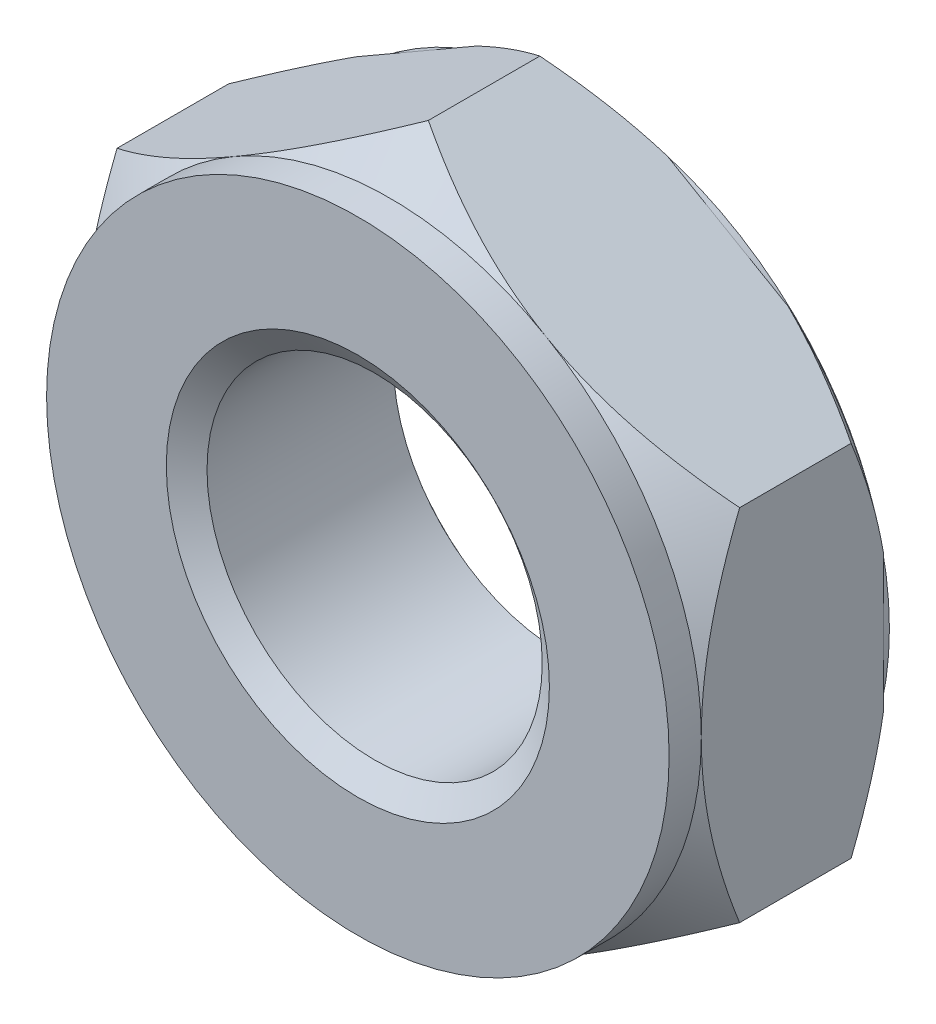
ISO-10303-21;
HEADER;
FILE_DESCRIPTION(('STEP AP214'),'2;1');
FILE_NAME('part.step','',(''),(''),'','','');
FILE_SCHEMA(('AUTOMOTIVE_DESIGN { 1 0 10303 214 1 1 1 1 }'));
ENDSEC;
DATA;
#1=APPLICATION_CONTEXT('core data for automotive mechanical design processes');
#2=APPLICATION_PROTOCOL_DEFINITION('international standard','automotive_design',2000,#1);
#3=PRODUCT_CONTEXT('',#1,'mechanical');
#4=PRODUCT('Part','Part','',(#3));
#5=PRODUCT_RELATED_PRODUCT_CATEGORY('part','',(#4));
#6=PRODUCT_DEFINITION_FORMATION('','',#4);
#7=PRODUCT_DEFINITION_CONTEXT('part definition',#1,'design');
#8=PRODUCT_DEFINITION('design','',#6,#7);
#9=PRODUCT_DEFINITION_SHAPE('','',#8);
#10=(LENGTH_UNIT() NAMED_UNIT(*) SI_UNIT(.MILLI.,.METRE.));
#11=(NAMED_UNIT(*) PLANE_ANGLE_UNIT() SI_UNIT($,.RADIAN.));
#12=(NAMED_UNIT(*) SI_UNIT($,.STERADIAN.) SOLID_ANGLE_UNIT());
#13=UNCERTAINTY_MEASURE_WITH_UNIT(LENGTH_MEASURE(1.E-05),#10,'distance_accuracy_value','');
#14=(GEOMETRIC_REPRESENTATION_CONTEXT(3) GLOBAL_UNCERTAINTY_ASSIGNED_CONTEXT((#13)) GLOBAL_UNIT_ASSIGNED_CONTEXT((#10,
#11,#12)) REPRESENTATION_CONTEXT('',''));
#15=CARTESIAN_POINT('',(0.,0.,0.));
#16=DIRECTION('',(0.,0.,1.));
#17=DIRECTION('',(1.,0.,0.));
#18=AXIS2_PLACEMENT_3D('',#15,#16,#17);
#19=CARTESIAN_POINT('',(0.,0.,-14.605));
#20=DIRECTION('',(0.,0.,1.));
#21=DIRECTION('',(1.,0.,0.));
#22=AXIS2_PLACEMENT_3D('',#19,#20,#21);
#23=CYLINDRICAL_SURFACE('',#22,11.1125);
#24=CARTESIAN_POINT('',(0.,0.,-1.11157946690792));
#25=DIRECTION('',(0.,0.,1.));
#26=DIRECTION('',(1.,0.,0.));
#27=AXIS2_PLACEMENT_3D('',#24,#25,#26);
#28=CIRCLE('',#27,11.1125);
#29=CARTESIAN_POINT('',(11.1125,0.,-1.11157946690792));
#30=VERTEX_POINT('',#29);
#31=EDGE_CURVE('E193',#30,#30,#28,.F.);
#32=CARTESIAN_POINT('',(0.,0.,-13.4680205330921));
#33=DIRECTION('',(0.,0.,-1.));
#34=DIRECTION('',(-1.,0.,0.));
#35=AXIS2_PLACEMENT_3D('',#32,#33,#34);
#36=CIRCLE('',#35,11.1125);
#37=CARTESIAN_POINT('',(11.1125,0.,-13.4680205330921));
#38=VERTEX_POINT('',#37);
#39=EDGE_CURVE('E46',#38,#38,#36,.F.);
#40=CARTESIAN_POINT('',(11.1125,0.,-1.11157946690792));
#41=CARTESIAN_POINT('',(11.1125,0.,-1.24029239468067));
#42=CARTESIAN_POINT('',(11.1125,0.,-1.36900532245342));
#43=CARTESIAN_POINT('',(11.1125,0.,-1.62643117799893));
#44=CARTESIAN_POINT('',(11.1125,0.,-1.75514410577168));
#45=CARTESIAN_POINT('',(11.1125,0.,-2.01256996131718));
#46=CARTESIAN_POINT('',(11.1125,0.,-2.14128288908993));
#47=CARTESIAN_POINT('',(11.1125,0.,-2.39870874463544));
#48=CARTESIAN_POINT('',(11.1125,0.,-2.52742167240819));
#49=CARTESIAN_POINT('',(11.1125,0.,-2.78484752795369));
#50=CARTESIAN_POINT('',(11.1125,0.,-2.91356045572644));
#51=CARTESIAN_POINT('',(11.1125,0.,-3.17098631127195));
#52=CARTESIAN_POINT('',(11.1125,0.,-3.2996992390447));
#53=CARTESIAN_POINT('',(11.1125,0.,-3.5571250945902));
#54=CARTESIAN_POINT('',(11.1125,0.,-3.68583802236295));
#55=CARTESIAN_POINT('',(11.1125,0.,-3.94326387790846));
#56=CARTESIAN_POINT('',(11.1125,0.,-4.07197680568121));
#57=CARTESIAN_POINT('',(11.1125,0.,-4.32940266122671));
#58=CARTESIAN_POINT('',(11.1125,0.,-4.45811558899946));
#59=CARTESIAN_POINT('',(11.1125,0.,-4.71554144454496));
#60=CARTESIAN_POINT('',(11.1125,0.,-4.84425437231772));
#61=CARTESIAN_POINT('',(11.1125,0.,-5.10168022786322));
#62=CARTESIAN_POINT('',(11.1125,0.,-5.23039315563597));
#63=CARTESIAN_POINT('',(11.1125,0.,-5.48781901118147));
#64=CARTESIAN_POINT('',(11.1125,0.,-5.61653193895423));
#65=CARTESIAN_POINT('',(11.1125,0.,-5.87395779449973));
#66=CARTESIAN_POINT('',(11.1125,0.,-6.00267072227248));
#67=CARTESIAN_POINT('',(11.1125,0.,-6.26009657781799));
#68=CARTESIAN_POINT('',(11.1125,0.,-6.38880950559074));
#69=CARTESIAN_POINT('',(11.1125,0.,-6.64623536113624));
#70=CARTESIAN_POINT('',(11.1125,0.,-6.77494828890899));
#71=CARTESIAN_POINT('',(11.1125,0.,-7.03237414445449));
#72=CARTESIAN_POINT('',(11.1125,0.,-7.16108707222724));
#73=CARTESIAN_POINT('',(11.1125,0.,-7.41851292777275));
#74=CARTESIAN_POINT('',(11.1125,0.,-7.5472258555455));
#75=CARTESIAN_POINT('',(11.1125,0.,-7.804651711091));
#76=CARTESIAN_POINT('',(11.1125,0.,-7.93336463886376));
#77=CARTESIAN_POINT('',(11.1125,0.,-8.19079049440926));
#78=CARTESIAN_POINT('',(11.1125,0.,-8.31950342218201));
#79=CARTESIAN_POINT('',(11.1125,0.,-8.57692927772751));
#80=CARTESIAN_POINT('',(11.1125,0.,-8.70564220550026));
#81=CARTESIAN_POINT('',(11.1125,0.,-8.96306806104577));
#82=CARTESIAN_POINT('',(11.1125,0.,-9.09178098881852));
#83=CARTESIAN_POINT('',(11.1125,0.,-9.34920684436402));
#84=CARTESIAN_POINT('',(11.1125,0.,-9.47791977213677));
#85=CARTESIAN_POINT('',(11.1125,0.,-9.73534562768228));
#86=CARTESIAN_POINT('',(11.1125,0.,-9.86405855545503));
#87=CARTESIAN_POINT('',(11.1125,0.,-10.1214844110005));
#88=CARTESIAN_POINT('',(11.1125,0.,-10.2501973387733));
#89=CARTESIAN_POINT('',(11.1125,0.,-10.5076231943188));
#90=CARTESIAN_POINT('',(11.1125,0.,-10.6363361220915));
#91=CARTESIAN_POINT('',(11.1125,0.,-10.893761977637));
#92=CARTESIAN_POINT('',(11.1125,0.,-11.0224749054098));
#93=CARTESIAN_POINT('',(11.1125,0.,-11.2799007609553));
#94=CARTESIAN_POINT('',(11.1125,0.,-11.408613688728));
#95=CARTESIAN_POINT('',(11.1125,0.,-11.6660395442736));
#96=CARTESIAN_POINT('',(11.1125,0.,-11.7947524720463));
#97=CARTESIAN_POINT('',(11.1125,0.,-12.0521783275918));
#98=CARTESIAN_POINT('',(11.1125,0.,-12.1808912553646));
#99=CARTESIAN_POINT('',(11.1125,0.,-12.4383171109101));
#100=CARTESIAN_POINT('',(11.1125,0.,-12.5670300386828));
#101=CARTESIAN_POINT('',(11.1125,0.,-12.8244558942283));
#102=CARTESIAN_POINT('',(11.1125,0.,-12.9531688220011));
#103=CARTESIAN_POINT('',(11.1125,0.,-13.2105946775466));
#104=CARTESIAN_POINT('',(11.1125,0.,-13.3393076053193));
#105=CARTESIAN_POINT('',(11.1125,0.,-13.4680205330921));
#106=B_SPLINE_CURVE_WITH_KNOTS('',3,(#40,#41,#42,#43,#44,#45,#46,#47,#48,#49,#50,#51,#52,#53,
#54,#55,#56,#57,#58,#59,#60,#61,#62,#63,#64,#65,#66,#67,#68,#69,#70,#71,#72,#73,#74,#75,#76,#77,
#78,#79,#80,#81,#82,#83,#84,#85,#86,#87,#88,#89,#90,#91,#92,#93,#94,#95,#96,#97,#98,#99,#100,
#101,#102,#103,#104,#105),.UNSPECIFIED.,.F.,.F.,(4,2,2,2,2,2,2,2,2,2,2,2,2,2,2,2,2,2,2,2,2,2,2,
2,2,2,2,2,2,2,2,2,4),(0.,0.386138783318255,0.77227756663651,1.15841634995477,1.54455513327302,
1.93069391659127,2.31683269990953,2.70297148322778,3.08911026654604,3.47524904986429,
3.86138783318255,4.2475266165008,4.63366539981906,5.01980418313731,5.40594296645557,
5.79208174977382,6.17822053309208,6.56435931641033,6.95049809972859,7.33663688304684,
7.7227756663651,8.10891444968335,8.49505323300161,8.88119201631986,9.26733079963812,
9.65346958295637,10.0396083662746,10.4257471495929,10.8118859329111,11.1980247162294,
11.5841634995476,11.9703022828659,12.3564410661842),.UNSPECIFIED.);
#107=EDGE_CURVE('BSEAM41',#30,#38,#106,.T.);
#108=ORIENTED_EDGE('',*,*,#31,.F.);
#109=ORIENTED_EDGE('',*,*,#39,.F.);
#110=ORIENTED_EDGE('',*,*,#107,.T.);
#111=ORIENTED_EDGE('',*,*,#107,.F.);
#112=EDGE_LOOP('',(#108,#110,#109,#111));
#113=FACE_BOUND('',#112,.T.);
#114=ADVANCED_FACE('F41',(#113),#23,.F.);
#115=CARTESIAN_POINT('',(0.,23.8301323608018,-14.605));
#116=DIRECTION('',(-0.500000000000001,0.866025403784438,0.));
#117=DIRECTION('',(-0.866025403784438,-0.500000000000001,0.));
#118=AXIS2_PLACEMENT_3D('',#115,#116,#117);
#119=PLANE('',#118);
#120=DIRECTION('',(0.,0.,1.));
#121=VECTOR('',#120,1.);
#122=CARTESIAN_POINT('',(-20.6375,11.9150661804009,-14.605));
#123=LINE('',#122,#121);
#124=CARTESIAN_POINT('',(-20.6375,11.9150661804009,-12.065));
#125=VERTEX_POINT('',#124);
#126=CARTESIAN_POINT('',(-20.6375,11.9150661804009,-4.67359999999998));
#127=VERTEX_POINT('',#126);
#128=EDGE_CURVE('E423',#125,#127,#123,.T.);
#129=ORIENTED_EDGE('',*,*,#128,.T.);
#130=CARTESIAN_POINT('',(-20.6377,11.914950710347,-4.67369186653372));
#131=CARTESIAN_POINT('',(-20.275187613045,12.1242473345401,-4.5071945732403));
#132=CARTESIAN_POINT('',(-19.9106890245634,12.3346906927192,-4.34633073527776));
#133=CARTESIAN_POINT('',(-19.1775207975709,12.7579855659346,-4.03738856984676));
#134=CARTESIAN_POINT('',(-18.8088498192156,12.9708378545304,-3.8893144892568));
#135=CARTESIAN_POINT('',(-18.0662260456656,13.3995918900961,-3.60714500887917));
#136=CARTESIAN_POINT('',(-17.6922603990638,13.6155010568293,-3.47309446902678));
#137=CARTESIAN_POINT('',(-16.9402681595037,14.0496639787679,-3.22123798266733));
#138=CARTESIAN_POINT('',(-16.5622419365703,14.2679175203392,-3.10343056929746));
#139=CARTESIAN_POINT('',(-15.8058382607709,14.704627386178,-2.88682070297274));
#140=CARTESIAN_POINT('',(-15.4274967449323,14.923062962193,-2.78785174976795));
#141=CARTESIAN_POINT('',(-14.6673819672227,15.3619154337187,-2.60924776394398));
#142=CARTESIAN_POINT('',(-14.2856086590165,15.582332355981,-2.52961299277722));
#143=CARTESIAN_POINT('',(-13.5196710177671,16.0245466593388,-2.39128087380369));
#144=CARTESIAN_POINT('',(-13.1355100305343,16.2463421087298,-2.33255897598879));
#145=CARTESIAN_POINT('',(-12.365131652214,16.6911202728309,-2.23715431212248));
#146=CARTESIAN_POINT('',(-11.9789142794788,16.9141029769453,-2.20047134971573));
#147=CARTESIAN_POINT('',(-11.1993126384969,17.3642061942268,-2.14957484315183));
#148=CARTESIAN_POINT('',(-10.8059106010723,17.5913369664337,-2.13572096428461));
#149=CARTESIAN_POINT('',(-10.0190181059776,18.0456495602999,-2.13193045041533));
#150=CARTESIAN_POINT('',(-9.62552764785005,18.2728313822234,-2.14199394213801));
#151=CARTESIAN_POINT('',(-8.83935351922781,18.7267292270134,-2.18580610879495));
#152=CARTESIAN_POINT('',(-8.44667032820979,18.9534449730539,-2.21956618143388));
#153=CARTESIAN_POINT('',(-7.66330095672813,19.4057234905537,-2.30999369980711));
#154=CARTESIAN_POINT('',(-7.27261478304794,19.6312862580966,-2.3666612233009));
#155=CARTESIAN_POINT('',(-6.49408280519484,20.0807719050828,-2.50166320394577));
#156=CARTESIAN_POINT('',(-6.10623692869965,20.3046948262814,-2.57999710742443));
#157=CARTESIAN_POINT('',(-5.3340295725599,20.7505289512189,-2.7567628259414));
#158=CARTESIAN_POINT('',(-4.94966816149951,20.9724401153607,-2.85519503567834));
#159=CARTESIAN_POINT('',(-3.80265971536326,21.6346657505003,-3.17799097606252));
#160=CARTESIAN_POINT('',(-3.04573810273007,22.0716746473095,-3.42991764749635));
#161=CARTESIAN_POINT('',(-1.90947060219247,22.7276989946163,-3.85730675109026));
#162=CARTESIAN_POINT('',(-1.52379699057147,22.950367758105,-4.0111848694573));
#163=CARTESIAN_POINT('',(-0.757992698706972,23.3925050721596,-4.33258642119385));
#164=CARTESIAN_POINT('',(-0.377849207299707,23.6119810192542,-4.5000690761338));
#165=CARTESIAN_POINT('',(0.000199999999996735,23.8302478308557,-4.67369186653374));
#166=B_SPLINE_CURVE_WITH_KNOTS('',3,(#130,#131,#132,#133,#134,#135,#136,#137,#138,#139,#140,
#141,#142,#143,#144,#145,#146,#147,#148,#149,#150,#151,#152,#153,#154,#155,#156,#157,#158,#159,
#160,#161,#162,#163,#164,#165),.UNSPECIFIED.,.F.,.F.,(4,2,2,2,2,2,2,2,2,2,2,2,2,2,2,2,2,4),(0.,
1.35150330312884,2.70345366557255,4.05960442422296,5.41563263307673,6.75905435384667,
8.10249424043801,9.44435179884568,10.7861974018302,12.1489880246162,13.5117858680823,
14.8752396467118,16.2386980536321,17.6021216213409,18.9655719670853,21.6912480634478,
23.1045997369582,24.5138611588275),.UNSPECIFIED.);
#167=CARTESIAN_POINT('',(-10.31875,17.8725992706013,-2.1336));
#168=VERTEX_POINT('',#167);
#169=EDGE_CURVE('E59',#127,#168,#166,.T.);
#170=ORIENTED_EDGE('',*,*,#169,.T.);
#171=CARTESIAN_POINT('',(0.,23.8301323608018,-4.6736));
#172=VERTEX_POINT('',#171);
#173=EDGE_CURVE('E209',#168,#172,#166,.T.);
#174=ORIENTED_EDGE('',*,*,#173,.T.);
#175=DIRECTION('',(0.,0.,1.));
#176=VECTOR('',#175,1.);
#177=CARTESIAN_POINT('',(0.,23.8301323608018,-14.605));
#178=LINE('',#177,#176);
#179=CARTESIAN_POINT('',(0.,23.8301323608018,-12.065));
#180=VERTEX_POINT('',#179);
#181=EDGE_CURVE('E384',#180,#172,#178,.T.);
#182=ORIENTED_EDGE('',*,*,#181,.F.);
#183=CARTESIAN_POINT('',(-34.9929737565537,3.62692954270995,-3.03490850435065));
#184=CARTESIAN_POINT('',(-34.457470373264,3.93610256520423,-3.43326172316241));
#185=CARTESIAN_POINT('',(-33.9202362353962,4.24627483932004,-3.82854536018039));
#186=CARTESIAN_POINT('',(-32.8416849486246,4.86897671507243,-4.61174531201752));
#187=CARTESIAN_POINT('',(-32.3003674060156,5.18150654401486,-4.99966090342));
#188=CARTESIAN_POINT('',(-31.2117173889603,5.81003892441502,-5.76781658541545));
#189=CARTESIAN_POINT('',(-30.664372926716,6.12604839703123,-6.14803407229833));
#190=CARTESIAN_POINT('',(-29.564382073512,6.76112841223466,-6.89808145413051));
#191=CARTESIAN_POINT('',(-29.0117358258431,7.08019887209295,-7.26791162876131));
#192=CARTESIAN_POINT('',(-27.874987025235,7.736501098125,-8.01174191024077));
#193=CARTESIAN_POINT('',(-27.2905993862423,8.07389745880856,-8.38516288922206));
#194=CARTESIAN_POINT('',(-26.1140797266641,8.75316140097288,-9.11551048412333));
#195=CARTESIAN_POINT('',(-25.5219473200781,9.09502920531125,-9.47243627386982));
#196=CARTESIAN_POINT('',(-24.3293659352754,9.78356638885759,-10.1657320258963));
#197=CARTESIAN_POINT('',(-23.728925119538,10.130231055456,-10.5021206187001));
#198=CARTESIAN_POINT('',(-22.5180769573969,10.829314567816,-11.1499537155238));
#199=CARTESIAN_POINT('',(-21.907670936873,11.1817326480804,-11.461401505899));
#200=CARTESIAN_POINT('',(-20.5846216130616,11.9455955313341,-12.0973411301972));
#201=CARTESIAN_POINT('',(-19.8702030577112,12.3580652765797,-12.4169561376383));
#202=CARTESIAN_POINT('',(-18.4253427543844,13.1922557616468,-13.0048088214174));
#203=CARTESIAN_POINT('',(-17.6949005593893,13.6139767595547,-13.2730450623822));
#204=CARTESIAN_POINT('',(-16.5937227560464,14.2497420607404,-13.6252560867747));
#205=CARTESIAN_POINT('',(-16.2287873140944,14.4604376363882,-13.7336065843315));
#206=CARTESIAN_POINT('',(-15.4954373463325,14.8838374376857,-13.933179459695));
#207=CARTESIAN_POINT('',(-15.1270232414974,15.0965414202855,-14.0244038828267));
#208=CARTESIAN_POINT('',(-14.3871147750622,15.5237277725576,-14.1882229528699));
#209=CARTESIAN_POINT('',(-14.0156206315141,15.7382100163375,-14.2608189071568));
#210=CARTESIAN_POINT('',(-13.2701030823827,16.1686347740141,-14.386049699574));
#211=CARTESIAN_POINT('',(-12.8960796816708,16.3845772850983,-14.4386845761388));
#212=CARTESIAN_POINT('',(-12.1413346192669,16.8203295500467,-14.5234827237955));
#213=CARTESIAN_POINT('',(-11.7605894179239,17.0401528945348,-14.5553686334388));
#214=CARTESIAN_POINT('',(-10.9981851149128,17.4803272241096,-14.5968592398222));
#215=CARTESIAN_POINT('',(-10.616526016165,17.7006782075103,-14.6064640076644));
#216=CARTESIAN_POINT('',(-9.85328707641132,18.1413344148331,-14.6031746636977));
#217=CARTESIAN_POINT('',(-9.47170723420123,18.3616396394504,-14.5902809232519));
#218=CARTESIAN_POINT('',(-8.70960039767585,18.8016422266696,-14.5422872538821));
#219=CARTESIAN_POINT('',(-8.32907341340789,19.0213395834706,-14.5071871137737));
#220=CARTESIAN_POINT('',(-7.56330545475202,19.4634559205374,-14.4147419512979));
#221=CARTESIAN_POINT('',(-7.17809904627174,19.685854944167,-14.3570171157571));
#222=CARTESIAN_POINT('',(-6.41050030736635,20.1290282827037,-14.220589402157));
#223=CARTESIAN_POINT('',(-6.02810798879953,20.3498025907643,-14.14188643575));
#224=CARTESIAN_POINT('',(-5.26673918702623,20.7893790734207,-13.9650184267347));
#225=CARTESIAN_POINT('',(-4.88776260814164,21.0081813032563,-13.8668539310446));
#226=CARTESIAN_POINT('',(-4.13362320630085,21.4435838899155,-13.6527386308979));
#227=CARTESIAN_POINT('',(-3.75846049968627,21.6601841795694,-13.5367872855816));
#228=CARTESIAN_POINT('',(-2.56707027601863,22.3480336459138,-13.1409485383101));
#229=CARTESIAN_POINT('',(-1.75836620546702,22.8149391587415,-12.8304544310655));
#230=CARTESIAN_POINT('',(-0.559924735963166,23.5068596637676,-12.3197112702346));
#231=CARTESIAN_POINT('',(-0.162739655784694,23.7361745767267,-12.1418910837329));
#232=CARTESIAN_POINT('',(0.627024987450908,24.1921454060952,-11.7730599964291));
#233=CARTESIAN_POINT('',(1.01960470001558,24.4188014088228,-11.5820495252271));
#234=CARTESIAN_POINT('',(1.80186071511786,24.8704371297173,-11.187774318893));
#235=CARTESIAN_POINT('',(2.19152047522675,25.0954072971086,-10.9844660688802));
#236=CARTESIAN_POINT('',(2.96676151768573,25.5429929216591,-10.5677045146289));
#237=CARTESIAN_POINT('',(3.3523426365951,25.7656082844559,-10.3542508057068));
#238=CARTESIAN_POINT('',(4.11961993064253,26.2085960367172,-9.91853957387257));
#239=CARTESIAN_POINT('',(4.50131711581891,26.4289690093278,-9.69628441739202));
#240=CARTESIAN_POINT('',(5.26124755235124,26.8677150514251,-9.24400357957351));
#241=CARTESIAN_POINT('',(5.63948071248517,27.0860880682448,-9.01397769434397));
#242=CARTESIAN_POINT('',(6.73278526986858,27.7173077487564,-8.33640295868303));
#243=CARTESIAN_POINT('',(7.44371470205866,28.1277630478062,-7.87993441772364));
#244=CARTESIAN_POINT('',(8.855992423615,28.9431419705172,-6.94760566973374));
#245=CARTESIAN_POINT('',(9.55733995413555,29.3480651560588,-6.47174393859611));
#246=CARTESIAN_POINT('',(10.5999695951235,29.9500276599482,-5.74865594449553));
#247=CARTESIAN_POINT('',(10.9443027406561,30.1488284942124,-5.50726814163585));
#248=CARTESIAN_POINT('',(11.631154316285,30.5453824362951,-5.02106915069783));
#249=CARTESIAN_POINT('',(11.9736727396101,30.7431355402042,-4.77625794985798));
#250=CARTESIAN_POINT('',(12.6569561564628,31.1376294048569,-4.28362204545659));
#251=CARTESIAN_POINT('',(12.9977215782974,31.3343704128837,-4.0357981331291));
#252=CARTESIAN_POINT('',(13.677715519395,31.7269650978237,-3.53736841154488));
#253=CARTESIAN_POINT('',(14.016944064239,31.9228187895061,-3.28676264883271));
#254=CARTESIAN_POINT('',(14.3554737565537,32.1182689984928,-3.03490850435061));
#255=B_SPLINE_CURVE_WITH_KNOTS('',3,(#183,#184,#185,#186,#187,#188,#189,#190,#191,#192,#193,
#194,#195,#196,#197,#198,#199,#200,#201,#202,#203,#204,#205,#206,#207,#208,#209,#210,#211,#212,
#213,#214,#215,#216,#217,#218,#219,#220,#221,#222,#223,#224,#225,#226,#227,#228,#229,#230,#231,
#232,#233,#234,#235,#236,#237,#238,#239,#240,#241,#242,#243,#244,#245,#246,#247,#248,#249,#250,
#251,#252,#253,#254),.UNSPECIFIED.,.F.,.F.,(4,2,2,2,2,2,2,2,2,2,2,2,2,2,2,2,2,2,2,2,2,2,2,2,2,2,
2,2,2,2,2,2,2,2,2,4),(0.,2.20667390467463,4.41356335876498,6.62619643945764,8.83876988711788,
11.152256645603,13.4658591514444,15.7773306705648,18.0884971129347,20.7412893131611,
23.3941556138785,24.6991558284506,26.0040000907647,27.3087527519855,28.6135029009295,
29.9353542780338,31.2572014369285,32.5790267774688,33.9008646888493,35.245915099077,
36.5909711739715,37.9359894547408,39.2810486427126,42.2300635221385,43.7056338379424,
45.1811561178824,46.6622453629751,48.1433937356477,49.6241465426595,51.1049382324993,
53.9224235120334,56.7401306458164,58.1355363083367,59.5309471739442,60.9259991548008,
62.3210278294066),.UNSPECIFIED.);
#256=CARTESIAN_POINT('',(-6.31764867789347,20.1826361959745,-14.1986));
#257=VERTEX_POINT('',#256);
#258=EDGE_CURVE('E320',#257,#180,#255,.T.);
#259=ORIENTED_EDGE('',*,*,#258,.F.);
#260=DIRECTION('',(-0.866025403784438,-0.500000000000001,0.));
#261=VECTOR('',#260,1.);
#262=CARTESIAN_POINT('',(0.,23.8301323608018,-14.1986));
#263=LINE('',#262,#261);
#264=CARTESIAN_POINT('',(-10.31875,17.8725992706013,-14.1986));
#265=VERTEX_POINT('',#264);
#266=EDGE_CURVE('E471',#257,#265,#263,.T.);
#267=ORIENTED_EDGE('',*,*,#266,.T.);
#268=CARTESIAN_POINT('',(-14.3198513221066,15.5625623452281,-14.1986));
#269=VERTEX_POINT('',#268);
#270=EDGE_CURVE('E456',#265,#269,#263,.T.);
#271=ORIENTED_EDGE('',*,*,#270,.T.);
#272=EDGE_CURVE('E300',#125,#269,#255,.T.);
#273=ORIENTED_EDGE('',*,*,#272,.F.);
#274=EDGE_LOOP('',(#129,#170,#174,#182,#259,#267,#271,#273));
#275=FACE_BOUND('',#274,.T.);
#276=ADVANCED_FACE('F43',(#275),#119,.T.);
#277=CARTESIAN_POINT('',(20.6375,11.9150661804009,-14.605));
#278=DIRECTION('',(0.500000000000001,0.866025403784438,0.));
#279=DIRECTION('',(-0.866025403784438,0.500000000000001,0.));
#280=AXIS2_PLACEMENT_3D('',#277,#278,#279);
#281=PLANE('',#280);
#282=ORIENTED_EDGE('',*,*,#181,.T.);
#283=CARTESIAN_POINT('',(-0.000200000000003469,23.8302478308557,-4.67369186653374));
#284=CARTESIAN_POINT('',(0.362312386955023,23.6209512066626,-4.50719457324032));
#285=CARTESIAN_POINT('',(0.726810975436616,23.4105078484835,-4.34633073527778));
#286=CARTESIAN_POINT('',(1.45997920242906,22.9872129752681,-4.03738856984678));
#287=CARTESIAN_POINT('',(1.8286501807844,22.7743606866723,-3.88931448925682));
#288=CARTESIAN_POINT('',(2.57127395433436,22.3456066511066,-3.60714500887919));
#289=CARTESIAN_POINT('',(2.94523960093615,22.1296974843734,-3.4730944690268));
#290=CARTESIAN_POINT('',(3.6972318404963,21.6955345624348,-3.22123798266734));
#291=CARTESIAN_POINT('',(4.07525806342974,21.4772810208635,-3.10343056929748));
#292=CARTESIAN_POINT('',(4.83166173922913,21.0405711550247,-2.88682070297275));
#293=CARTESIAN_POINT('',(5.21000325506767,20.8221355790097,-2.78785174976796));
#294=CARTESIAN_POINT('',(5.97011803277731,20.383283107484,-2.60924776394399));
#295=CARTESIAN_POINT('',(6.35189134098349,20.1628661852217,-2.52961299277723));
#296=CARTESIAN_POINT('',(7.11782898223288,19.7206518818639,-2.3912808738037));
#297=CARTESIAN_POINT('',(7.50198996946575,19.4988564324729,-2.3325589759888));
#298=CARTESIAN_POINT('',(8.27236834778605,19.0540782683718,-2.23715431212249));
#299=CARTESIAN_POINT('',(8.65858572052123,18.8310955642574,-2.20047134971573));
#300=CARTESIAN_POINT('',(9.43818736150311,18.3809923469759,-2.14957484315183));
#301=CARTESIAN_POINT('',(9.83158939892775,18.153861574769,-2.13572096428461));
#302=CARTESIAN_POINT('',(10.6184818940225,17.6995489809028,-2.13193045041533));
#303=CARTESIAN_POINT('',(11.01197235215,17.4723671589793,-2.14199394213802));
#304=CARTESIAN_POINT('',(11.7981464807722,17.0184693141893,-2.18580610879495));
#305=CARTESIAN_POINT('',(12.1908296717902,16.7917535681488,-2.21956618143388));
#306=CARTESIAN_POINT('',(12.9741990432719,16.339475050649,-2.30999369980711));
#307=CARTESIAN_POINT('',(13.3648852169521,16.1139122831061,-2.3666612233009));
#308=CARTESIAN_POINT('',(14.1434171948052,15.6644266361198,-2.50166320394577));
#309=CARTESIAN_POINT('',(14.5312630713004,15.4405037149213,-2.57999710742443));
#310=CARTESIAN_POINT('',(15.3034704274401,14.9946695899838,-2.7567628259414));
#311=CARTESIAN_POINT('',(15.6878318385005,14.7727584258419,-2.85519503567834));
#312=CARTESIAN_POINT('',(16.8348402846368,14.1105327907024,-3.17799097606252));
#313=CARTESIAN_POINT('',(17.59176189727,13.6735238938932,-3.42991764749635));
#314=CARTESIAN_POINT('',(18.7280293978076,13.0174995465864,-3.85730675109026));
#315=CARTESIAN_POINT('',(19.1137030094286,12.7948307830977,-4.0111848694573));
#316=CARTESIAN_POINT('',(19.879507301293,12.3526934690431,-4.33258642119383));
#317=CARTESIAN_POINT('',(20.2596507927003,12.1332175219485,-4.50006907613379));
#318=CARTESIAN_POINT('',(20.6377,11.9149507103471,-4.67369186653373));
#319=B_SPLINE_CURVE_WITH_KNOTS('',3,(#283,#284,#285,#286,#287,#288,#289,#290,#291,#292,#293,
#294,#295,#296,#297,#298,#299,#300,#301,#302,#303,#304,#305,#306,#307,#308,#309,#310,#311,#312,
#313,#314,#315,#316,#317,#318),.UNSPECIFIED.,.F.,.F.,(4,2,2,2,2,2,2,2,2,2,2,2,2,2,2,2,2,4),(0.,
1.35150330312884,2.70345366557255,4.05960442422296,5.41563263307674,6.75905435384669,
8.10249424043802,9.44435179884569,10.7861974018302,12.1489880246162,13.5117858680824,
14.8752396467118,16.2386980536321,17.602121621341,18.9655719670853,21.6912480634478,
23.1045997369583,24.5138611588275),.UNSPECIFIED.);
#320=CARTESIAN_POINT('',(10.31875,17.8725992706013,-2.1336));
#321=VERTEX_POINT('',#320);
#322=EDGE_CURVE('E206',#172,#321,#319,.T.);
#323=ORIENTED_EDGE('',*,*,#322,.T.);
#324=CARTESIAN_POINT('',(20.6375,11.9150661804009,-4.6736));
#325=VERTEX_POINT('',#324);
#326=EDGE_CURVE('E198',#321,#325,#319,.T.);
#327=ORIENTED_EDGE('',*,*,#326,.T.);
#328=DIRECTION('',(0.,0.,1.));
#329=VECTOR('',#328,1.);
#330=CARTESIAN_POINT('',(20.6375,11.9150661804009,-14.605));
#331=LINE('',#330,#329);
#332=CARTESIAN_POINT('',(20.6375,11.9150661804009,-12.065));
#333=VERTEX_POINT('',#332);
#334=EDGE_CURVE('E205',#333,#325,#331,.T.);
#335=ORIENTED_EDGE('',*,*,#334,.F.);
#336=CARTESIAN_POINT('',(-14.3554737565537,32.1182689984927,-3.03490850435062));
#337=CARTESIAN_POINT('',(-13.819970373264,31.8090959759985,-3.43326172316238));
#338=CARTESIAN_POINT('',(-13.2827362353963,31.4989237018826,-3.82854536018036));
#339=CARTESIAN_POINT('',(-12.2041849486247,30.8762218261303,-4.61174531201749));
#340=CARTESIAN_POINT('',(-11.6628674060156,30.5636919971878,-4.99966090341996));
#341=CARTESIAN_POINT('',(-10.5742173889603,29.9351596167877,-5.76781658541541));
#342=CARTESIAN_POINT('',(-10.026872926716,29.6191501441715,-6.14803407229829));
#343=CARTESIAN_POINT('',(-8.92688207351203,28.984070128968,-6.89808145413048));
#344=CARTESIAN_POINT('',(-8.37423582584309,28.6649996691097,-7.26791162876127));
#345=CARTESIAN_POINT('',(-7.23748702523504,28.0086974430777,-8.01174191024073));
#346=CARTESIAN_POINT('',(-6.65309938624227,27.6713010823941,-8.38516288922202));
#347=CARTESIAN_POINT('',(-5.47657972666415,26.9920371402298,-9.11551048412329));
#348=CARTESIAN_POINT('',(-4.88444732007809,26.6501693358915,-9.47243627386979));
#349=CARTESIAN_POINT('',(-3.69186593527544,25.9616321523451,-10.1657320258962));
#350=CARTESIAN_POINT('',(-3.09142511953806,25.6149674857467,-10.5021206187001));
#351=CARTESIAN_POINT('',(-1.8805769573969,24.9158839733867,-11.1499537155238));
#352=CARTESIAN_POINT('',(-1.27017093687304,24.5634658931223,-11.461401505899));
#353=CARTESIAN_POINT('',(0.052878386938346,23.7996030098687,-12.0973411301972));
#354=CARTESIAN_POINT('',(0.767296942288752,23.387133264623,-12.4169561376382));
#355=CARTESIAN_POINT('',(2.2121572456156,22.5529427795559,-13.0048088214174));
#356=CARTESIAN_POINT('',(2.94259944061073,22.131221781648,-13.2730450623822));
#357=CARTESIAN_POINT('',(4.04377724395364,21.4954564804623,-13.6252560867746));
#358=CARTESIAN_POINT('',(4.4087126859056,21.2847609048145,-13.7336065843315));
#359=CARTESIAN_POINT('',(5.14206265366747,20.861361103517,-13.933179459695));
#360=CARTESIAN_POINT('',(5.51047675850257,20.6486571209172,-14.0244038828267));
#361=CARTESIAN_POINT('',(6.25038522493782,20.2214707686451,-14.1882229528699));
#362=CARTESIAN_POINT('',(6.62187936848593,20.0069885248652,-14.2608189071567));
#363=CARTESIAN_POINT('',(7.36739691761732,19.5765637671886,-14.386049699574));
#364=CARTESIAN_POINT('',(7.74142031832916,19.3606212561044,-14.4386845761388));
#365=CARTESIAN_POINT('',(8.49616538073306,18.924868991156,-14.5234827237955));
#366=CARTESIAN_POINT('',(8.87691058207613,18.7050456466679,-14.5553686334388));
#367=CARTESIAN_POINT('',(9.63931488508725,18.2648713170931,-14.5968592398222));
#368=CARTESIAN_POINT('',(10.020973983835,18.0445203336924,-14.6064640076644));
#369=CARTESIAN_POINT('',(10.7842129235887,17.6038641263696,-14.6031746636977));
#370=CARTESIAN_POINT('',(11.1657927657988,17.3835589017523,-14.5902809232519));
#371=CARTESIAN_POINT('',(11.9278996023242,16.9435563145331,-14.5422872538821));
#372=CARTESIAN_POINT('',(12.3084265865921,16.7238589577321,-14.5071871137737));
#373=CARTESIAN_POINT('',(13.074194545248,16.2817426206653,-14.4147419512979));
#374=CARTESIAN_POINT('',(13.4594009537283,16.0593435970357,-14.3570171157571));
#375=CARTESIAN_POINT('',(14.2269996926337,15.616170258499,-14.220589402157));
#376=CARTESIAN_POINT('',(14.6093920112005,15.3953959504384,-14.14188643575));
#377=CARTESIAN_POINT('',(15.3707608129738,14.955819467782,-13.9650184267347));
#378=CARTESIAN_POINT('',(15.7497373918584,14.7370172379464,-13.8668539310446));
#379=CARTESIAN_POINT('',(16.5038767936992,14.3016146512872,-13.6527386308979));
#380=CARTESIAN_POINT('',(16.8790395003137,14.0850143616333,-13.5367872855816));
#381=CARTESIAN_POINT('',(18.0704297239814,13.3971648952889,-13.1409485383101));
#382=CARTESIAN_POINT('',(18.879133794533,12.9302593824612,-12.8304544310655));
#383=CARTESIAN_POINT('',(20.0775752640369,12.2383388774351,-12.3197112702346));
#384=CARTESIAN_POINT('',(20.4747603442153,12.009023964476,-12.141891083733));
#385=CARTESIAN_POINT('',(21.2645249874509,11.5530531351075,-11.7730599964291));
#386=CARTESIAN_POINT('',(21.6571047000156,11.3263971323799,-11.5820495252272));
#387=CARTESIAN_POINT('',(22.4393607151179,10.8747614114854,-11.187774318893));
#388=CARTESIAN_POINT('',(22.8290204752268,10.6497912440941,-10.9844660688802));
#389=CARTESIAN_POINT('',(23.6042615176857,10.2022056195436,-10.5677045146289));
#390=CARTESIAN_POINT('',(23.9898426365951,9.97959025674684,-10.3542508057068));
#391=CARTESIAN_POINT('',(24.7571199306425,9.53660250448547,-9.91853957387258));
#392=CARTESIAN_POINT('',(25.1388171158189,9.31622953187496,-9.69628441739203));
#393=CARTESIAN_POINT('',(25.8987475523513,8.87748348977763,-9.24400357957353));
#394=CARTESIAN_POINT('',(26.2769807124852,8.65911047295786,-9.01397769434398));
#395=CARTESIAN_POINT('',(27.3702852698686,8.02789079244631,-8.33640295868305));
#396=CARTESIAN_POINT('',(28.0812147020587,7.61743549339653,-7.87993441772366));
#397=CARTESIAN_POINT('',(29.493492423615,6.80205657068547,-6.94760566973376));
#398=CARTESIAN_POINT('',(30.1948399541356,6.39713338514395,-6.47174393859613));
#399=CARTESIAN_POINT('',(31.2374695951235,5.79517088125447,-5.74865594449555));
#400=CARTESIAN_POINT('',(31.5818027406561,5.59637004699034,-5.50726814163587));
#401=CARTESIAN_POINT('',(32.268654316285,5.19981610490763,-5.02106915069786));
#402=CARTESIAN_POINT('',(32.6111727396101,5.0020630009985,-4.77625794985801));
#403=CARTESIAN_POINT('',(33.2944561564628,4.60756913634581,-4.28362204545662));
#404=CARTESIAN_POINT('',(33.6352215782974,4.41082812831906,-4.03579813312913));
#405=CARTESIAN_POINT('',(34.315215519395,4.01823344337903,-3.5373684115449));
#406=CARTESIAN_POINT('',(34.654444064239,3.82237975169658,-3.28676264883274));
#407=CARTESIAN_POINT('',(34.9929737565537,3.62692954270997,-3.03490850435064));
#408=B_SPLINE_CURVE_WITH_KNOTS('',3,(#336,#337,#338,#339,#340,#341,#342,#343,#344,#345,#346,
#347,#348,#349,#350,#351,#352,#353,#354,#355,#356,#357,#358,#359,#360,#361,#362,#363,#364,#365,
#366,#367,#368,#369,#370,#371,#372,#373,#374,#375,#376,#377,#378,#379,#380,#381,#382,#383,#384,
#385,#386,#387,#388,#389,#390,#391,#392,#393,#394,#395,#396,#397,#398,#399,#400,#401,#402,#403,
#404,#405,#406,#407),.UNSPECIFIED.,.F.,.F.,(4,2,2,2,2,2,2,2,2,2,2,2,2,2,2,2,2,2,2,2,2,2,2,2,2,2,
2,2,2,2,2,2,2,2,2,4),(0.,2.20667390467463,4.41356335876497,6.62619643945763,8.83876988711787,
11.152256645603,13.4658591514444,15.7773306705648,18.0884971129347,20.7412893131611,
23.3941556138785,24.6991558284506,26.0040000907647,27.3087527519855,28.6135029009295,
29.9353542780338,31.2572014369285,32.5790267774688,33.9008646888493,35.245915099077,
36.5909711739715,37.9359894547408,39.2810486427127,42.2300635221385,43.7056338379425,
45.1811561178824,46.6622453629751,48.1433937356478,49.6241465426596,51.1049382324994,
53.9224235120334,56.7401306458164,58.1355363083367,59.5309471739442,60.9259991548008,
62.3210278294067),.UNSPECIFIED.);
#409=CARTESIAN_POINT('',(14.3198513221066,15.5625623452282,-14.1986));
#410=VERTEX_POINT('',#409);
#411=EDGE_CURVE('E322',#410,#333,#408,.T.);
#412=ORIENTED_EDGE('',*,*,#411,.F.);
#413=DIRECTION('',(-0.866025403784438,0.500000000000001,0.));
#414=VECTOR('',#413,1.);
#415=CARTESIAN_POINT('',(20.6375,11.9150661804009,-14.1986));
#416=LINE('',#415,#414);
#417=CARTESIAN_POINT('',(10.31875,17.8725992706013,-14.1986));
#418=VERTEX_POINT('',#417);
#419=EDGE_CURVE('E476',#410,#418,#416,.T.);
#420=ORIENTED_EDGE('',*,*,#419,.T.);
#421=CARTESIAN_POINT('',(6.31764867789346,20.1826361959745,-14.1986));
#422=VERTEX_POINT('',#421);
#423=EDGE_CURVE('E437',#418,#422,#416,.T.);
#424=ORIENTED_EDGE('',*,*,#423,.T.);
#425=EDGE_CURVE('E314',#180,#422,#408,.T.);
#426=ORIENTED_EDGE('',*,*,#425,.F.);
#427=EDGE_LOOP('',(#282,#323,#327,#335,#412,#420,#424,#426));
#428=FACE_BOUND('',#427,.T.);
#429=ADVANCED_FACE('F324',(#428),#281,.T.);
#430=CARTESIAN_POINT('',(20.6375,11.9150661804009,-14.605));
#431=DIRECTION('',(-1.,0.,0.));
#432=DIRECTION('',(0.,-1.,0.));
#433=AXIS2_PLACEMENT_3D('',#430,#431,#432);
#434=PLANE('',#433);
#435=CARTESIAN_POINT('',(20.6375,-27.3310068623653,-12.9614568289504));
#436=CARTESIAN_POINT('',(20.6375,-26.9764041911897,-12.7363203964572));
#437=CARTESIAN_POINT('',(20.6375,-26.6210859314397,-12.5123117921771));
#438=CARTESIAN_POINT('',(20.6375,-25.9088880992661,-12.0667793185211));
#439=CARTESIAN_POINT('',(20.6375,-25.552008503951,-11.8452554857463));
#440=CARTESIAN_POINT('',(20.6375,-24.4787066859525,-11.1846775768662));
#441=CARTESIAN_POINT('',(20.6375,-23.7597615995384,-10.7497063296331));
#442=CARTESIAN_POINT('',(20.6375,-22.309097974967,-9.89007970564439));
#443=CARTESIAN_POINT('',(20.6375,-21.5773258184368,-9.46551460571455));
#444=CARTESIAN_POINT('',(20.6375,-20.1044765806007,-8.63289204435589));
#445=CARTESIAN_POINT('',(20.6375,-19.3634000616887,-8.22483359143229));
#446=CARTESIAN_POINT('',(20.6375,-17.8336682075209,-7.40963670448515));
#447=CARTESIAN_POINT('',(20.6375,-17.0444625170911,-7.0035258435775));
#448=CARTESIAN_POINT('',(20.6375,-15.4518309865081,-6.21971717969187));
#449=CARTESIAN_POINT('',(20.6375,-14.6484032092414,-5.84202328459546));
#450=CARTESIAN_POINT('',(20.6375,-13.027440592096,-5.12385429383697));
#451=CARTESIAN_POINT('',(20.6375,-12.209947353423,-4.78328596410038));
#452=CARTESIAN_POINT('',(20.6375,-10.5572902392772,-4.14825523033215));
#453=CARTESIAN_POINT('',(20.6375,-9.72213334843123,-3.85377497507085));
#454=CARTESIAN_POINT('',(20.6375,-8.45298549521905,-3.45477737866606));
#455=CARTESIAN_POINT('',(20.6375,-8.02577859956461,-3.32855715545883));
#456=CARTESIAN_POINT('',(20.6375,-7.16684068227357,-3.09250855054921));
#457=CARTESIAN_POINT('',(20.6375,-6.73510979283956,-2.98267969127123));
#458=CARTESIAN_POINT('',(20.6375,-5.86742319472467,-2.78109368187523));
#459=CARTESIAN_POINT('',(20.6375,-5.43146741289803,-2.68933684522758));
#460=CARTESIAN_POINT('',(20.6375,-4.55587783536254,-2.52550904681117));
#461=CARTESIAN_POINT('',(20.6375,-4.11624426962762,-2.45343686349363));
#462=CARTESIAN_POINT('',(20.6375,-3.24174184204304,-2.3314596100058));
#463=CARTESIAN_POINT('',(20.6375,-2.806924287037,-2.28118859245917));
#464=CARTESIAN_POINT('',(20.6375,-1.9353364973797,-2.20204057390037));
#465=CARTESIAN_POINT('',(20.6375,-1.49856627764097,-2.17316340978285));
#466=CARTESIAN_POINT('',(20.6375,-0.624142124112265,-2.13743377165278));
#467=CARTESIAN_POINT('',(20.6375,-0.186488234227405,-2.13058022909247));
#468=CARTESIAN_POINT('',(20.6375,0.688600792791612,-2.1390494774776));
#469=CARTESIAN_POINT('',(20.6375,1.12603593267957,-2.15437198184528));
#470=CARTESIAN_POINT('',(20.6375,1.96675880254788,-2.20487582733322));
#471=CARTESIAN_POINT('',(20.6375,2.37014278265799,-2.23847859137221));
#472=CARTESIAN_POINT('',(20.6375,3.17498456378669,-2.32373653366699));
#473=CARTESIAN_POINT('',(20.6375,3.57644239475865,-2.37539143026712));
#474=CARTESIAN_POINT('',(20.6375,4.37677596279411,-2.49586473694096));
#475=CARTESIAN_POINT('',(20.6375,4.77565160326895,-2.56468378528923));
#476=CARTESIAN_POINT('',(20.6375,5.57028429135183,-2.71839286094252));
#477=CARTESIAN_POINT('',(20.6375,5.96604130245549,-2.80328307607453));
#478=CARTESIAN_POINT('',(20.6375,6.76173880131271,-2.98972027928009));
#479=CARTESIAN_POINT('',(20.6375,7.16161052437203,-3.09155962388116));
#480=CARTESIAN_POINT('',(20.6375,7.95748056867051,-3.30934255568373));
#481=CARTESIAN_POINT('',(20.6375,8.35347886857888,-3.42528622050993));
#482=CARTESIAN_POINT('',(20.6375,9.14142015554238,-3.66992483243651));
#483=CARTESIAN_POINT('',(20.6375,9.53336391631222,-3.79861729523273));
#484=CARTESIAN_POINT('',(20.6375,10.3132623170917,-4.06749740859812));
#485=CARTESIAN_POINT('',(20.6375,10.7012170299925,-4.20768484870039));
#486=CARTESIAN_POINT('',(20.6375,11.7633483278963,-4.60759113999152));
#487=CARTESIAN_POINT('',(20.6375,12.4335234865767,-4.87796702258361));
#488=CARTESIAN_POINT('',(20.6375,13.7628599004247,-5.44469144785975));
#489=CARTESIAN_POINT('',(20.6375,14.4220187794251,-5.74104550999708));
#490=CARTESIAN_POINT('',(20.6375,15.7308411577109,-6.35528083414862));
#491=CARTESIAN_POINT('',(20.6375,16.380496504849,-6.67317939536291));
#492=CARTESIAN_POINT('',(20.6375,17.6708554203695,-7.3264770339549));
#493=CARTESIAN_POINT('',(20.6375,18.3115595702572,-7.66187496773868));
#494=CARTESIAN_POINT('',(20.6375,19.5880109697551,-8.3486924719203));
#495=CARTESIAN_POINT('',(20.6375,20.2237230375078,-8.70017722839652));
#496=CARTESIAN_POINT('',(20.6375,21.4882685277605,-9.41529881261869));
#497=CARTESIAN_POINT('',(20.6375,22.1171018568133,-9.77893580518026));
#498=CARTESIAN_POINT('',(20.6375,23.3685028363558,-10.5162262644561));
#499=CARTESIAN_POINT('',(20.6375,23.9910729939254,-10.8898754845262));
#500=CARTESIAN_POINT('',(20.6375,25.2309760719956,-11.6457421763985));
#501=CARTESIAN_POINT('',(20.6375,25.8483090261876,-12.0279595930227));
#502=CARTESIAN_POINT('',(20.6375,27.022582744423,-12.764656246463));
#503=CARTESIAN_POINT('',(20.6375,27.5799197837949,-13.1185047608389));
#504=CARTESIAN_POINT('',(20.6375,28.6912411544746,-13.8314314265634));
#505=CARTESIAN_POINT('',(20.6375,29.2452254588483,-14.1905096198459));
#506=CARTESIAN_POINT('',(20.6375,30.9028313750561,-15.2746247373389));
#507=CARTESIAN_POINT('',(20.6375,32.0020009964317,-16.0064759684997));
#508=CARTESIAN_POINT('',(20.6375,33.6381714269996,-17.1110566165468));
#509=CARTESIAN_POINT('',(20.6375,34.1787567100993,-17.4785056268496));
#510=CARTESIAN_POINT('',(20.6375,35.2578368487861,-18.2164655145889));
#511=CARTESIAN_POINT('',(20.6375,35.7963317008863,-18.5869763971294));
#512=CARTESIAN_POINT('',(20.6375,36.8713310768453,-19.3306380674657));
#513=CARTESIAN_POINT('',(20.6375,37.4078359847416,-19.7037883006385));
#514=CARTESIAN_POINT('',(20.6375,38.4791400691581,-20.4525207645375));
#515=CARTESIAN_POINT('',(20.6375,39.0139392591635,-20.8281029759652));
#516=CARTESIAN_POINT('',(20.6375,39.5479768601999,-21.2047627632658));
#517=B_SPLINE_CURVE_WITH_KNOTS('',3,(#435,#436,#437,#438,#439,#440,#441,#442,#443,#444,#445,
#446,#447,#448,#449,#450,#451,#452,#453,#454,#455,#456,#457,#458,#459,#460,#461,#462,#463,#464,
#465,#466,#467,#468,#469,#470,#471,#472,#473,#474,#475,#476,#477,#478,#479,#480,#481,#482,#483,
#484,#485,#486,#487,#488,#489,#490,#491,#492,#493,#494,#495,#496,#497,#498,#499,#500,#501,#502,
#503,#504,#505,#506,#507,#508,#509,#510,#511,#512,#513,#514,#515,#516),.UNSPECIFIED.,.F.,.F.,(4,
2,2,2,2,2,2,2,2,2,2,2,2,2,2,2,2,2,2,2,2,2,2,2,2,2,2,2,2,2,2,2,2,2,2,2,2,2,2,2,4),(0.,
1.26010130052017,2.52022113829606,5.04095926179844,7.57884086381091,10.1165697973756,
12.7788175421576,15.4414307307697,18.0971952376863,20.7519285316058,22.0880503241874,
23.4241331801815,24.7602392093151,26.0962623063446,27.4088985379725,28.7215247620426,
30.0340872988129,31.3466328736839,32.5605613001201,33.7744707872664,34.9884254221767,
36.2023942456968,37.4400199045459,38.677652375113,39.9150441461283,41.1524132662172,
43.319660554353,45.4873694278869,47.656839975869,49.8261689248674,52.0052399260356,
54.1843404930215,56.3625309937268,58.5407074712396,60.5212046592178,62.5017177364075,
66.4631162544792,68.4240443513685,70.3849757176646,72.3455065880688,74.3060219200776),.UNSPECIFIED.);
#518=CARTESIAN_POINT('',(20.6375,-11.9150661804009,-4.6736));
#519=VERTEX_POINT('',#518);
#520=CARTESIAN_POINT('',(20.6375,0.,-2.1336));
#521=VERTEX_POINT('',#520);
#522=EDGE_CURVE('E170',#519,#521,#517,.T.);
#523=ORIENTED_EDGE('',*,*,#522,.F.);
#524=DIRECTION('',(0.,0.,1.));
#525=VECTOR('',#524,1.);
#526=CARTESIAN_POINT('',(20.6375,-11.9150661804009,-14.605));
#527=LINE('',#526,#525);
#528=CARTESIAN_POINT('',(20.6375,-11.9150661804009,-12.065));
#529=VERTEX_POINT('',#528);
#530=EDGE_CURVE('E413',#529,#519,#527,.T.);
#531=ORIENTED_EDGE('',*,*,#530,.F.);
#532=CARTESIAN_POINT('',(20.6375,-26.2705399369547,-4.44558055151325));
#533=CARTESIAN_POINT('',(20.6375,-25.9550120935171,-4.64297904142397));
#534=CARTESIAN_POINT('',(20.6375,-25.6388771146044,-4.83940634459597));
#535=CARTESIAN_POINT('',(20.6375,-25.0052951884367,-5.23014162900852));
#536=CARTESIAN_POINT('',(20.6375,-24.6878482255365,-5.42444958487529));
#537=CARTESIAN_POINT('',(20.6375,-23.733310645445,-6.00397872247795));
#538=CARTESIAN_POINT('',(20.6375,-23.0941160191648,-6.38574705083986));
#539=CARTESIAN_POINT('',(20.6375,-21.8064681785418,-7.13995916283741));
#540=CARTESIAN_POINT('',(20.6375,-21.1579866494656,-7.51235469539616));
#541=CARTESIAN_POINT('',(20.6375,-19.853567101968,-8.24381843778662));
#542=CARTESIAN_POINT('',(20.6375,-19.1976294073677,-8.60288722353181));
#543=CARTESIAN_POINT('',(20.6375,-17.8477675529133,-9.3205308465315));
#544=CARTESIAN_POINT('',(20.6375,-17.153451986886,-9.6783725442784));
#545=CARTESIAN_POINT('',(20.6375,-15.7539860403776,-10.3724554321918));
#546=CARTESIAN_POINT('',(20.6375,-15.04883477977,-10.708694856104));
#547=CARTESIAN_POINT('',(20.6375,-13.6274363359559,-11.353901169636));
#548=CARTESIAN_POINT('',(20.6375,-12.9112087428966,-11.6629108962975));
#549=CARTESIAN_POINT('',(20.6375,-11.4654750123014,-12.247816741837));
#550=CARTESIAN_POINT('',(20.6375,-10.7359719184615,-12.523720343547));
#551=CARTESIAN_POINT('',(20.6375,-9.19222343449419,-13.0592301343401));
#552=CARTESIAN_POINT('',(20.6375,-8.37653556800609,-13.3147671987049));
#553=CARTESIAN_POINT('',(20.6375,-7.14060675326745,-13.6526964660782));
#554=CARTESIAN_POINT('',(20.6375,-6.726516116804,-13.7577862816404));
#555=CARTESIAN_POINT('',(20.6375,-5.8944864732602,-13.9513464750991));
#556=CARTESIAN_POINT('',(20.6375,-5.47654792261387,-14.0398187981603));
#557=CARTESIAN_POINT('',(20.6375,-4.64382841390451,-14.1974880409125));
#558=CARTESIAN_POINT('',(20.6375,-4.22910077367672,-14.2669655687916));
#559=CARTESIAN_POINT('',(20.6375,-3.39693490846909,-14.3872509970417));
#560=CARTESIAN_POINT('',(20.6375,-2.97949671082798,-14.4380590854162));
#561=CARTESIAN_POINT('',(20.6375,-2.14273760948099,-14.5200432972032));
#562=CARTESIAN_POINT('',(20.6375,-1.72341694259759,-14.5512218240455));
#563=CARTESIAN_POINT('',(20.6375,-0.883754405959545,-14.5933334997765));
#564=CARTESIAN_POINT('',(20.6375,-0.463412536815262,-14.6042666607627));
#565=CARTESIAN_POINT('',(20.6375,0.379332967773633,-14.6056652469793));
#566=CARTESIAN_POINT('',(20.6375,0.801736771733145,-14.5960317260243));
#567=CARTESIAN_POINT('',(20.6375,1.64557544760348,-14.5562962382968));
#568=CARTESIAN_POINT('',(20.6375,2.06701031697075,-14.526194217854));
#569=CARTESIAN_POINT('',(20.6375,2.90803185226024,-14.4461259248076));
#570=CARTESIAN_POINT('',(20.6375,3.32761827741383,-14.3961571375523));
#571=CARTESIAN_POINT('',(20.6375,4.16409217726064,-14.277310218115));
#572=CARTESIAN_POINT('',(20.6375,4.58097962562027,-14.2084319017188));
#573=CARTESIAN_POINT('',(20.6375,5.41807483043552,-14.051730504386));
#574=CARTESIAN_POINT('',(20.6375,5.83822894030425,-13.9636218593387));
#575=CARTESIAN_POINT('',(20.6375,6.67466795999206,-13.7705619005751));
#576=CARTESIAN_POINT('',(20.6375,7.09095240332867,-13.6656085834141));
#577=CARTESIAN_POINT('',(20.6375,8.33341339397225,-13.3277783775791));
#578=CARTESIAN_POINT('',(20.6375,9.15339089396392,-13.0718937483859));
#579=CARTESIAN_POINT('',(20.6375,10.7030728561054,-12.5358357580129));
#580=CARTESIAN_POINT('',(20.6375,11.4342762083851,-12.2599011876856));
#581=CARTESIAN_POINT('',(20.6375,12.8833422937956,-11.6747012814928));
#582=CARTESIAN_POINT('',(20.6375,13.6012019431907,-11.3654283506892));
#583=CARTESIAN_POINT('',(20.6375,15.0258086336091,-10.7195158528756));
#584=CARTESIAN_POINT('',(20.6375,15.7325358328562,-10.3828328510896));
#585=CARTESIAN_POINT('',(20.6375,17.1350948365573,-9.68773071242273));
#586=CARTESIAN_POINT('',(20.6375,17.8309275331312,-9.32931336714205));
#587=CARTESIAN_POINT('',(20.6375,19.1836435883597,-8.61048201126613));
#588=CARTESIAN_POINT('',(20.6375,19.840921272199,-8.25080692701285));
#589=CARTESIAN_POINT('',(20.6375,21.147985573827,-7.51806385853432));
#590=CARTESIAN_POINT('',(20.6375,21.7977718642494,-7.14499529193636));
#591=CARTESIAN_POINT('',(20.6375,23.0879696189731,-6.38940380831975));
#592=CARTESIAN_POINT('',(20.6375,23.7284097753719,-6.00692979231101));
#593=CARTESIAN_POINT('',(20.6375,24.6847978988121,-5.42631360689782));
#594=CARTESIAN_POINT('',(20.6375,25.0028585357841,-5.23163868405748));
#595=CARTESIAN_POINT('',(20.6375,25.6376625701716,-4.84016097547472));
#596=CARTESIAN_POINT('',(20.6375,25.9544059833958,-4.64335821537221));
#597=CARTESIAN_POINT('',(20.6375,26.2705399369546,-4.44558055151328));
#598=B_SPLINE_CURVE_WITH_KNOTS('',3,(#532,#533,#534,#535,#536,#537,#538,#539,#540,#541,#542,
#543,#544,#545,#546,#547,#548,#549,#550,#551,#552,#553,#554,#555,#556,#557,#558,#559,#560,#561,
#562,#563,#564,#565,#566,#567,#568,#569,#570,#571,#572,#573,#574,#575,#576,#577,#578,#579,#580,
#581,#582,#583,#584,#585,#586,#587,#588,#589,#590,#591,#592,#593,#594,#595,#596,#597),
.UNSPECIFIED.,.F.,.F.,(4,2,2,2,2,2,2,2,2,2,2,2,2,2,2,2,2,2,2,2,2,2,2,2,2,2,2,2,2,2,2,2,4),(0.,
1.11656102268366,2.23313539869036,4.4666123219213,6.70988695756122,8.95306453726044,
11.2960713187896,13.6392694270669,15.9787128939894,18.3176265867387,20.8797848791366,
22.1611579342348,23.4423809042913,24.7035048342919,25.9646160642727,27.2255728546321,
28.486528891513,29.7535650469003,31.0206045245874,32.2878044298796,33.5550166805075,
34.8425104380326,36.1301574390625,38.7048623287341,41.0485714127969,43.3928155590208,
45.7408495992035,48.0886903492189,50.3362660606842,52.5839396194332,54.8217094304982,
55.9404287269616,57.05913455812),.UNSPECIFIED.);
#599=CARTESIAN_POINT('',(20.6375,-4.62007385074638,-14.1986));
#600=VERTEX_POINT('',#599);
#601=EDGE_CURVE('E488',#529,#600,#598,.T.);
#602=ORIENTED_EDGE('',*,*,#601,.T.);
#603=DIRECTION('',(0.,-1.,0.));
#604=VECTOR('',#603,1.);
#605=CARTESIAN_POINT('',(20.6375,11.9150661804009,-14.1986));
#606=LINE('',#605,#604);
#607=CARTESIAN_POINT('',(20.6375,0.,-14.1986));
#608=VERTEX_POINT('',#607);
#609=EDGE_CURVE('E429',#608,#600,#606,.T.);
#610=ORIENTED_EDGE('',*,*,#609,.F.);
#611=CARTESIAN_POINT('',(20.6375,4.62007385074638,-14.1986));
#612=VERTEX_POINT('',#611);
#613=EDGE_CURVE('E425',#612,#608,#606,.T.);
#614=ORIENTED_EDGE('',*,*,#613,.F.);
#615=EDGE_CURVE('E67',#612,#333,#598,.T.);
#616=ORIENTED_EDGE('',*,*,#615,.T.);
#617=ORIENTED_EDGE('',*,*,#334,.T.);
#618=EDGE_CURVE('E182',#521,#325,#517,.T.);
#619=ORIENTED_EDGE('',*,*,#618,.F.);
#620=EDGE_LOOP('',(#523,#531,#602,#610,#614,#616,#617,#619));
#621=FACE_BOUND('',#620,.T.);
#622=ADVANCED_FACE('F203',(#621),#434,.F.);
#623=CARTESIAN_POINT('',(0.,-23.8301323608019,-14.605));
#624=DIRECTION('',(0.500000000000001,-0.866025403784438,0.));
#625=DIRECTION('',(0.866025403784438,0.500000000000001,0.));
#626=AXIS2_PLACEMENT_3D('',#623,#624,#625);
#627=PLANE('',#626);
#628=ORIENTED_EDGE('',*,*,#530,.T.);
#629=CARTESIAN_POINT('',(20.6377,-11.9149507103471,-4.67369186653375));
#630=CARTESIAN_POINT('',(20.275187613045,-12.1242473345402,-4.50719457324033));
#631=CARTESIAN_POINT('',(19.9106890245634,-12.3346906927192,-4.34633073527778));
#632=CARTESIAN_POINT('',(19.1775207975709,-12.7579855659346,-4.03738856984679));
#633=CARTESIAN_POINT('',(18.8088498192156,-12.9708378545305,-3.88931448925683));
#634=CARTESIAN_POINT('',(18.0662260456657,-13.3995918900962,-3.6071450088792));
#635=CARTESIAN_POINT('',(17.6922603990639,-13.6155010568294,-3.47309446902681));
#636=CARTESIAN_POINT('',(16.9402681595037,-14.0496639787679,-3.22123798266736));
#637=CARTESIAN_POINT('',(16.5622419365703,-14.2679175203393,-3.1034305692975));
#638=CARTESIAN_POINT('',(15.8058382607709,-14.7046273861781,-2.88682070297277));
#639=CARTESIAN_POINT('',(15.4274967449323,-14.9230629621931,-2.78785174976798));
#640=CARTESIAN_POINT('',(14.6673819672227,-15.3619154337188,-2.60924776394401));
#641=CARTESIAN_POINT('',(14.2856086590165,-15.582332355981,-2.52961299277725));
#642=CARTESIAN_POINT('',(13.5196710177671,-16.0245466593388,-2.39128087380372));
#643=CARTESIAN_POINT('',(13.1355100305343,-16.2463421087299,-2.33255897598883));
#644=CARTESIAN_POINT('',(12.365131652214,-16.691120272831,-2.23715431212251));
#645=CARTESIAN_POINT('',(11.9789142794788,-16.9141029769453,-2.20047134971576));
#646=CARTESIAN_POINT('',(11.1993126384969,-17.3642061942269,-2.14957484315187));
#647=CARTESIAN_POINT('',(10.8059106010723,-17.5913369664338,-2.13572096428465));
#648=CARTESIAN_POINT('',(10.0190181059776,-18.0456495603,-2.13193045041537));
#649=CARTESIAN_POINT('',(9.62552764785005,-18.2728313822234,-2.14199394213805));
#650=CARTESIAN_POINT('',(8.8393535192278,-18.7267292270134,-2.18580610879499));
#651=CARTESIAN_POINT('',(8.44667032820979,-18.9534449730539,-2.21956618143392));
#652=CARTESIAN_POINT('',(7.66330095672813,-19.4057234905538,-2.30999369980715));
#653=CARTESIAN_POINT('',(7.27261478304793,-19.6312862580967,-2.36666122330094));
#654=CARTESIAN_POINT('',(6.49408280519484,-20.0807719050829,-2.50166320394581));
#655=CARTESIAN_POINT('',(6.10623692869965,-20.3046948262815,-2.57999710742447));
#656=CARTESIAN_POINT('',(5.33402957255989,-20.750528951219,-2.75676282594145));
#657=CARTESIAN_POINT('',(4.94966816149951,-20.9724401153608,-2.85519503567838));
#658=CARTESIAN_POINT('',(3.80265971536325,-21.6346657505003,-3.17799097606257));
#659=CARTESIAN_POINT('',(3.04573810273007,-22.0716746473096,-3.4299176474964));
#660=CARTESIAN_POINT('',(1.90947060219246,-22.7276989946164,-3.8573067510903));
#661=CARTESIAN_POINT('',(1.52379699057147,-22.9503677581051,-4.01118486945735));
#662=CARTESIAN_POINT('',(0.757992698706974,-23.3925050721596,-4.33258642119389));
#663=CARTESIAN_POINT('',(0.37784920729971,-23.6119810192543,-4.50006907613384));
#664=CARTESIAN_POINT('',(-0.000199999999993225,-23.8302478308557,-4.67369186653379));
#665=B_SPLINE_CURVE_WITH_KNOTS('',3,(#629,#630,#631,#632,#633,#634,#635,#636,#637,#638,#639,
#640,#641,#642,#643,#644,#645,#646,#647,#648,#649,#650,#651,#652,#653,#654,#655,#656,#657,#658,
#659,#660,#661,#662,#663,#664),.UNSPECIFIED.,.F.,.F.,(4,2,2,2,2,2,2,2,2,2,2,2,2,2,2,2,2,4),(0.,
1.35150330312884,2.70345366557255,4.05960442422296,5.41563263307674,6.75905435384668,
8.10249424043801,9.44435179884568,10.7861974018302,12.1489880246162,13.5117858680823,
14.8752396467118,16.2386980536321,17.6021216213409,18.9655719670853,21.6912480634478,
23.1045997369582,24.5138611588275),.UNSPECIFIED.);
#666=CARTESIAN_POINT('',(10.31875,-17.8725992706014,-2.1336));
#667=VERTEX_POINT('',#666);
#668=EDGE_CURVE('E176',#519,#667,#665,.T.);
#669=ORIENTED_EDGE('',*,*,#668,.T.);
#670=CARTESIAN_POINT('',(0.,-23.8301323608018,-4.6736));
#671=VERTEX_POINT('',#670);
#672=EDGE_CURVE('E217',#667,#671,#665,.T.);
#673=ORIENTED_EDGE('',*,*,#672,.T.);
#674=DIRECTION('',(0.,0.,1.));
#675=VECTOR('',#674,1.);
#676=CARTESIAN_POINT('',(0.,-23.8301323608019,-14.605));
#677=LINE('',#676,#675);
#678=CARTESIAN_POINT('',(0.,-23.8301323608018,-12.065));
#679=VERTEX_POINT('',#678);
#680=EDGE_CURVE('E410',#679,#671,#677,.T.);
#681=ORIENTED_EDGE('',*,*,#680,.F.);
#682=CARTESIAN_POINT('',(34.9929737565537,-3.62692954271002,-3.03490850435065));
#683=CARTESIAN_POINT('',(34.457470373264,-3.93610256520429,-3.43326172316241));
#684=CARTESIAN_POINT('',(33.9202362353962,-4.24627483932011,-3.82854536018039));
#685=CARTESIAN_POINT('',(32.8416849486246,-4.8689767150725,-4.61174531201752));
#686=CARTESIAN_POINT('',(32.3003674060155,-5.18150654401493,-4.99966090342));
#687=CARTESIAN_POINT('',(31.2117173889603,-5.8100389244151,-5.76781658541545));
#688=CARTESIAN_POINT('',(30.6643729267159,-6.1260483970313,-6.14803407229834));
#689=CARTESIAN_POINT('',(29.564382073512,-6.76112841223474,-6.89808145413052));
#690=CARTESIAN_POINT('',(29.011735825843,-7.08019887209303,-7.26791162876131));
#691=CARTESIAN_POINT('',(27.874987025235,-7.73650109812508,-8.01174191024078));
#692=CARTESIAN_POINT('',(27.2905993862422,-8.07389745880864,-8.38516288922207));
#693=CARTESIAN_POINT('',(26.1140797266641,-8.75316140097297,-9.11551048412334));
#694=CARTESIAN_POINT('',(25.521947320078,-9.09502920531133,-9.47243627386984));
#695=CARTESIAN_POINT('',(24.3293659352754,-9.78356638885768,-10.1657320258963));
#696=CARTESIAN_POINT('',(23.728925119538,-10.1302310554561,-10.5021206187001));
#697=CARTESIAN_POINT('',(22.5180769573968,-10.8293145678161,-11.1499537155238));
#698=CARTESIAN_POINT('',(21.907670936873,-11.1817326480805,-11.461401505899));
#699=CARTESIAN_POINT('',(20.5846216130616,-11.9455955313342,-12.0973411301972));
#700=CARTESIAN_POINT('',(19.8702030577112,-12.3580652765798,-12.4169561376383));
#701=CARTESIAN_POINT('',(18.4253427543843,-13.1922557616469,-13.0048088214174));
#702=CARTESIAN_POINT('',(17.6949005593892,-13.6139767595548,-13.2730450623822));
#703=CARTESIAN_POINT('',(16.5937227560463,-14.2497420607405,-13.6252560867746));
#704=CARTESIAN_POINT('',(16.2287873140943,-14.4604376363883,-13.7336065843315));
#705=CARTESIAN_POINT('',(15.4954373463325,-14.8838374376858,-13.933179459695));
#706=CARTESIAN_POINT('',(15.1270232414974,-15.0965414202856,-14.0244038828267));
#707=CARTESIAN_POINT('',(14.3871147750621,-15.5237277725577,-14.1882229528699));
#708=CARTESIAN_POINT('',(14.015620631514,-15.7382100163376,-14.2608189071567));
#709=CARTESIAN_POINT('',(13.2701030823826,-16.1686347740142,-14.386049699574));
#710=CARTESIAN_POINT('',(12.8960796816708,-16.3845772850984,-14.4386845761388));
#711=CARTESIAN_POINT('',(12.1413346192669,-16.8203295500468,-14.5234827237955));
#712=CARTESIAN_POINT('',(11.7605894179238,-17.0401528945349,-14.5553686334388));
#713=CARTESIAN_POINT('',(10.9981851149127,-17.4803272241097,-14.5968592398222));
#714=CARTESIAN_POINT('',(10.6165260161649,-17.7006782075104,-14.6064640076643));
#715=CARTESIAN_POINT('',(9.85328707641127,-18.1413344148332,-14.6031746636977));
#716=CARTESIAN_POINT('',(9.47170723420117,-18.3616396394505,-14.5902809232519));
#717=CARTESIAN_POINT('',(8.70960039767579,-18.8016422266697,-14.5422872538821));
#718=CARTESIAN_POINT('',(8.32907341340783,-19.0213395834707,-14.5071871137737));
#719=CARTESIAN_POINT('',(7.56330545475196,-19.4634559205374,-14.4147419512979));
#720=CARTESIAN_POINT('',(7.17809904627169,-19.6858549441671,-14.357017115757));
#721=CARTESIAN_POINT('',(6.4105003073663,-20.1290282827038,-14.2205894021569));
#722=CARTESIAN_POINT('',(6.02810798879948,-20.3498025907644,-14.1418864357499));
#723=CARTESIAN_POINT('',(5.26673918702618,-20.7893790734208,-13.9650184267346));
#724=CARTESIAN_POINT('',(4.88776260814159,-21.0081813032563,-13.8668539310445));
#725=CARTESIAN_POINT('',(4.1336232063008,-21.4435838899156,-13.6527386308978));
#726=CARTESIAN_POINT('',(3.75846049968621,-21.6601841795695,-13.5367872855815));
#727=CARTESIAN_POINT('',(2.56707027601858,-22.3480336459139,-13.1409485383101));
#728=CARTESIAN_POINT('',(1.75836620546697,-22.8149391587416,-12.8304544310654));
#729=CARTESIAN_POINT('',(0.55992473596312,-23.5068596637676,-12.3197112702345));
#730=CARTESIAN_POINT('',(0.162739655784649,-23.7361745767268,-12.1418910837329));
#731=CARTESIAN_POINT('',(-0.627024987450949,-24.1921454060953,-11.773059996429));
#732=CARTESIAN_POINT('',(-1.01960470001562,-24.4188014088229,-11.5820495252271));
#733=CARTESIAN_POINT('',(-1.80186071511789,-24.8704371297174,-11.187774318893));
#734=CARTESIAN_POINT('',(-2.19152047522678,-25.0954072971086,-10.9844660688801));
#735=CARTESIAN_POINT('',(-2.96676151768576,-25.5429929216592,-10.5677045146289));
#736=CARTESIAN_POINT('',(-3.35234263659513,-25.7656082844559,-10.3542508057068));
#737=CARTESIAN_POINT('',(-4.11961993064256,-26.2085960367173,-9.91853957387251));
#738=CARTESIAN_POINT('',(-4.50131711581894,-26.4289690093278,-9.69628441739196));
#739=CARTESIAN_POINT('',(-5.26124755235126,-26.8677150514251,-9.24400357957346));
#740=CARTESIAN_POINT('',(-5.63948071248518,-27.0860880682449,-9.01397769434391));
#741=CARTESIAN_POINT('',(-6.73278526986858,-27.7173077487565,-8.33640295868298));
#742=CARTESIAN_POINT('',(-7.44371470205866,-28.1277630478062,-7.8799344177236));
#743=CARTESIAN_POINT('',(-8.855992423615,-28.9431419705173,-6.9476056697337));
#744=CARTESIAN_POINT('',(-9.55733995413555,-29.3480651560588,-6.47174393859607));
#745=CARTESIAN_POINT('',(-10.5999695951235,-29.9500276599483,-5.74865594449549));
#746=CARTESIAN_POINT('',(-10.944302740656,-30.1488284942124,-5.50726814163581));
#747=CARTESIAN_POINT('',(-11.631154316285,-30.5453824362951,-5.02106915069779));
#748=CARTESIAN_POINT('',(-11.9736727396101,-30.7431355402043,-4.77625794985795));
#749=CARTESIAN_POINT('',(-12.6569561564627,-31.137629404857,-4.28362204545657));
#750=CARTESIAN_POINT('',(-12.9977215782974,-31.3343704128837,-4.03579813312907));
#751=CARTESIAN_POINT('',(-13.677715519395,-31.7269650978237,-3.53736841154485));
#752=CARTESIAN_POINT('',(-14.0169440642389,-31.9228187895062,-3.28676264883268));
#753=CARTESIAN_POINT('',(-14.3554737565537,-32.1182689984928,-3.03490850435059));
#754=B_SPLINE_CURVE_WITH_KNOTS('',3,(#682,#683,#684,#685,#686,#687,#688,#689,#690,#691,#692,
#693,#694,#695,#696,#697,#698,#699,#700,#701,#702,#703,#704,#705,#706,#707,#708,#709,#710,#711,
#712,#713,#714,#715,#716,#717,#718,#719,#720,#721,#722,#723,#724,#725,#726,#727,#728,#729,#730,
#731,#732,#733,#734,#735,#736,#737,#738,#739,#740,#741,#742,#743,#744,#745,#746,#747,#748,#749,
#750,#751,#752,#753),.UNSPECIFIED.,.F.,.F.,(4,2,2,2,2,2,2,2,2,2,2,2,2,2,2,2,2,2,2,2,2,2,2,2,2,2,
2,2,2,2,2,2,2,2,2,4),(0.,2.20667390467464,4.41356335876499,6.62619643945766,8.83876988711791,
11.1522566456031,13.4658591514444,15.7773306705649,18.0884971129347,20.7412893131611,
23.3941556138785,24.6991558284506,26.0040000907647,27.3087527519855,28.6135029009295,
29.9353542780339,31.2572014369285,32.5790267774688,33.9008646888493,35.2459150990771,
36.5909711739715,37.9359894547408,39.2810486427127,42.2300635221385,43.7056338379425,
45.1811561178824,46.6622453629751,48.1433937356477,49.6241465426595,51.1049382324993,
53.9224235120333,56.7401306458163,58.1355363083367,59.5309471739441,60.9259991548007,
62.3210278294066),.UNSPECIFIED.);
#755=CARTESIAN_POINT('',(6.31764867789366,-20.1826361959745,-14.1986));
#756=VERTEX_POINT('',#755);
#757=EDGE_CURVE('E307',#756,#679,#754,.T.);
#758=ORIENTED_EDGE('',*,*,#757,.F.);
#759=DIRECTION('',(0.866025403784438,0.500000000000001,0.));
#760=VECTOR('',#759,1.);
#761=CARTESIAN_POINT('',(0.,-23.8301323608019,-14.1986));
#762=LINE('',#761,#760);
#763=CARTESIAN_POINT('',(10.31875,-17.8725992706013,-14.1986));
#764=VERTEX_POINT('',#763);
#765=EDGE_CURVE('E472',#756,#764,#762,.T.);
#766=ORIENTED_EDGE('',*,*,#765,.T.);
#767=CARTESIAN_POINT('',(14.3198513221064,-15.5625623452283,-14.1986));
#768=VERTEX_POINT('',#767);
#769=EDGE_CURVE('E435',#764,#768,#762,.T.);
#770=ORIENTED_EDGE('',*,*,#769,.T.);
#771=EDGE_CURVE('E415',#529,#768,#754,.T.);
#772=ORIENTED_EDGE('',*,*,#771,.F.);
#773=EDGE_LOOP('',(#628,#669,#673,#681,#758,#766,#770,#772));
#774=FACE_BOUND('',#773,.T.);
#775=ADVANCED_FACE('F264',(#774),#627,.T.);
#776=CARTESIAN_POINT('',(-20.6375,-11.9150661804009,-14.605));
#777=DIRECTION('',(-0.500000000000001,-0.866025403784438,0.));
#778=DIRECTION('',(0.866025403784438,-0.500000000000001,0.));
#779=AXIS2_PLACEMENT_3D('',#776,#777,#778);
#780=PLANE('',#779);
#781=ORIENTED_EDGE('',*,*,#680,.T.);
#782=CARTESIAN_POINT('',(0.000200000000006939,-23.8302478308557,-4.67369186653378));
#783=CARTESIAN_POINT('',(-0.362312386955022,-23.6209512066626,-4.50719457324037));
#784=CARTESIAN_POINT('',(-0.726810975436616,-23.4105078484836,-4.34633073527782));
#785=CARTESIAN_POINT('',(-1.45997920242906,-22.9872129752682,-4.03738856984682));
#786=CARTESIAN_POINT('',(-1.8286501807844,-22.7743606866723,-3.88931448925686));
#787=CARTESIAN_POINT('',(-2.57127395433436,-22.3456066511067,-3.60714500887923));
#788=CARTESIAN_POINT('',(-2.94523960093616,-22.1296974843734,-3.47309446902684));
#789=CARTESIAN_POINT('',(-3.6972318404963,-21.6955345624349,-3.22123798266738));
#790=CARTESIAN_POINT('',(-4.07525806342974,-21.4772810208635,-3.10343056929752));
#791=CARTESIAN_POINT('',(-4.83166173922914,-21.0405711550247,-2.88682070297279));
#792=CARTESIAN_POINT('',(-5.21000325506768,-20.8221355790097,-2.787851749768));
#793=CARTESIAN_POINT('',(-5.97011803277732,-20.383283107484,-2.60924776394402));
#794=CARTESIAN_POINT('',(-6.3518913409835,-20.1628661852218,-2.52961299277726));
#795=CARTESIAN_POINT('',(-7.11782898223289,-19.720651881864,-2.39128087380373));
#796=CARTESIAN_POINT('',(-7.50198996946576,-19.4988564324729,-2.33255897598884));
#797=CARTESIAN_POINT('',(-8.27236834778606,-19.0540782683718,-2.23715431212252));
#798=CARTESIAN_POINT('',(-8.65858572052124,-18.8310955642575,-2.20047134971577));
#799=CARTESIAN_POINT('',(-9.43818736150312,-18.3809923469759,-2.14957484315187));
#800=CARTESIAN_POINT('',(-9.83158939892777,-18.153861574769,-2.13572096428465));
#801=CARTESIAN_POINT('',(-10.6184818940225,-17.6995489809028,-2.13193045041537));
#802=CARTESIAN_POINT('',(-11.01197235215,-17.4723671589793,-2.14199394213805));
#803=CARTESIAN_POINT('',(-11.7981464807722,-17.0184693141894,-2.18580610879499));
#804=CARTESIAN_POINT('',(-12.1908296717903,-16.7917535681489,-2.21956618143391));
#805=CARTESIAN_POINT('',(-12.9741990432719,-16.339475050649,-2.30999369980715));
#806=CARTESIAN_POINT('',(-13.3648852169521,-16.1139122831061,-2.36666122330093));
#807=CARTESIAN_POINT('',(-14.1434171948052,-15.6644266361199,-2.50166320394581));
#808=CARTESIAN_POINT('',(-14.5312630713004,-15.4405037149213,-2.57999710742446));
#809=CARTESIAN_POINT('',(-15.3034704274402,-14.9946695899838,-2.75676282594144));
#810=CARTESIAN_POINT('',(-15.6878318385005,-14.772758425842,-2.85519503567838));
#811=CARTESIAN_POINT('',(-16.8348402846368,-14.1105327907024,-3.17799097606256));
#812=CARTESIAN_POINT('',(-17.59176189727,-13.6735238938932,-3.42991764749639));
#813=CARTESIAN_POINT('',(-18.7280293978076,-13.0174995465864,-3.85730675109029));
#814=CARTESIAN_POINT('',(-19.1137030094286,-12.7948307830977,-4.01118486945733));
#815=CARTESIAN_POINT('',(-19.879507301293,-12.3526934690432,-4.33258642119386));
#816=CARTESIAN_POINT('',(-20.2596507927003,-12.1332175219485,-4.50006907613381));
#817=CARTESIAN_POINT('',(-20.6377,-11.9149507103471,-4.67369186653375));
#818=B_SPLINE_CURVE_WITH_KNOTS('',3,(#782,#783,#784,#785,#786,#787,#788,#789,#790,#791,#792,
#793,#794,#795,#796,#797,#798,#799,#800,#801,#802,#803,#804,#805,#806,#807,#808,#809,#810,#811,
#812,#813,#814,#815,#816,#817),.UNSPECIFIED.,.F.,.F.,(4,2,2,2,2,2,2,2,2,2,2,2,2,2,2,2,2,4),(0.,
1.35150330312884,2.70345366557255,4.05960442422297,5.41563263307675,6.7590543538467,
8.10249424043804,9.44435179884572,10.7861974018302,12.1489880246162,13.5117858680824,
14.8752396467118,16.2386980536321,17.602121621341,18.9655719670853,21.6912480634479,
23.1045997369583,24.5138611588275),.UNSPECIFIED.);
#819=CARTESIAN_POINT('',(-10.31875,-17.8725992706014,-2.1336));
#820=VERTEX_POINT('',#819);
#821=EDGE_CURVE('E258',#671,#820,#818,.T.);
#822=ORIENTED_EDGE('',*,*,#821,.T.);
#823=CARTESIAN_POINT('',(-20.6375,-11.9150661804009,-4.6736));
#824=VERTEX_POINT('',#823);
#825=EDGE_CURVE('E200',#820,#824,#818,.T.);
#826=ORIENTED_EDGE('',*,*,#825,.T.);
#827=DIRECTION('',(0.,0.,1.));
#828=VECTOR('',#827,1.);
#829=CARTESIAN_POINT('',(-20.6375,-11.9150661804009,-14.605));
#830=LINE('',#829,#828);
#831=CARTESIAN_POINT('',(-20.6375,-11.9150661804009,-12.065));
#832=VERTEX_POINT('',#831);
#833=EDGE_CURVE('E419',#832,#824,#830,.T.);
#834=ORIENTED_EDGE('',*,*,#833,.F.);
#835=CARTESIAN_POINT('',(14.3554737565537,-32.1182689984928,-3.03490850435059));
#836=CARTESIAN_POINT('',(13.819970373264,-31.8090959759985,-3.43326172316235));
#837=CARTESIAN_POINT('',(13.2827362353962,-31.4989237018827,-3.82854536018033));
#838=CARTESIAN_POINT('',(12.2041849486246,-30.8762218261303,-4.61174531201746));
#839=CARTESIAN_POINT('',(11.6628674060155,-30.5636919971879,-4.99966090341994));
#840=CARTESIAN_POINT('',(10.5742173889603,-29.9351596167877,-5.76781658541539));
#841=CARTESIAN_POINT('',(10.026872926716,-29.6191501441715,-6.14803407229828));
#842=CARTESIAN_POINT('',(8.92688207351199,-28.9840701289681,-6.89808145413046));
#843=CARTESIAN_POINT('',(8.37423582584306,-28.6649996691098,-7.26791162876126));
#844=CARTESIAN_POINT('',(7.23748702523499,-28.0086974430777,-8.01174191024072));
#845=CARTESIAN_POINT('',(6.65309938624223,-27.6713010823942,-8.38516288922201));
#846=CARTESIAN_POINT('',(5.4765797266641,-26.9920371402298,-9.11551048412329));
#847=CARTESIAN_POINT('',(4.88444732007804,-26.6501693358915,-9.47243627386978));
#848=CARTESIAN_POINT('',(3.69186593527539,-25.9616321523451,-10.1657320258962));
#849=CARTESIAN_POINT('',(3.091425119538,-25.6149674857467,-10.5021206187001));
#850=CARTESIAN_POINT('',(1.88057695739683,-24.9158839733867,-11.1499537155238));
#851=CARTESIAN_POINT('',(1.27017093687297,-24.5634658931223,-11.461401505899));
#852=CARTESIAN_POINT('',(-0.0528783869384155,-23.7996030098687,-12.0973411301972));
#853=CARTESIAN_POINT('',(-0.767296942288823,-23.387133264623,-12.4169561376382));
#854=CARTESIAN_POINT('',(-2.21215724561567,-22.5529427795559,-13.0048088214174));
#855=CARTESIAN_POINT('',(-2.9425994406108,-22.131221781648,-13.2730450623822));
#856=CARTESIAN_POINT('',(-4.04377724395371,-21.4954564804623,-13.6252560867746));
#857=CARTESIAN_POINT('',(-4.40871268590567,-21.2847609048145,-13.7336065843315));
#858=CARTESIAN_POINT('',(-5.14206265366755,-20.861361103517,-13.933179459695));
#859=CARTESIAN_POINT('',(-5.51047675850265,-20.6486571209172,-14.0244038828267));
#860=CARTESIAN_POINT('',(-6.2503852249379,-20.2214707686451,-14.1882229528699));
#861=CARTESIAN_POINT('',(-6.62187936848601,-20.0069885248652,-14.2608189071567));
#862=CARTESIAN_POINT('',(-7.36739691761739,-19.5765637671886,-14.3860496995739));
#863=CARTESIAN_POINT('',(-7.74142031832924,-19.3606212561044,-14.4386845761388));
#864=CARTESIAN_POINT('',(-8.49616538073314,-18.924868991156,-14.5234827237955));
#865=CARTESIAN_POINT('',(-8.87691058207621,-18.7050456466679,-14.5553686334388));
#866=CARTESIAN_POINT('',(-9.63931488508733,-18.2648713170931,-14.5968592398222));
#867=CARTESIAN_POINT('',(-10.0209739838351,-18.0445203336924,-14.6064640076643));
#868=CARTESIAN_POINT('',(-10.7842129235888,-17.6038641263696,-14.6031746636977));
#869=CARTESIAN_POINT('',(-11.1657927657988,-17.3835589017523,-14.5902809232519));
#870=CARTESIAN_POINT('',(-11.9278996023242,-16.9435563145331,-14.5422872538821));
#871=CARTESIAN_POINT('',(-12.3084265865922,-16.7238589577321,-14.5071871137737));
#872=CARTESIAN_POINT('',(-13.0741945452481,-16.2817426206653,-14.4147419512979));
#873=CARTESIAN_POINT('',(-13.4594009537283,-16.0593435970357,-14.357017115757));
#874=CARTESIAN_POINT('',(-14.2269996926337,-15.616170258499,-14.2205894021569));
#875=CARTESIAN_POINT('',(-14.6093920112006,-15.3953959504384,-14.1418864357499));
#876=CARTESIAN_POINT('',(-15.3707608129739,-14.955819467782,-13.9650184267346));
#877=CARTESIAN_POINT('',(-15.7497373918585,-14.7370172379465,-13.8668539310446));
#878=CARTESIAN_POINT('',(-16.5038767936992,-14.3016146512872,-13.6527386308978));
#879=CARTESIAN_POINT('',(-16.8790395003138,-14.0850143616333,-13.5367872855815));
#880=CARTESIAN_POINT('',(-18.0704297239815,-13.3971648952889,-13.1409485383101));
#881=CARTESIAN_POINT('',(-18.8791337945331,-12.9302593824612,-12.8304544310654));
#882=CARTESIAN_POINT('',(-20.0775752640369,-12.2383388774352,-12.3197112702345));
#883=CARTESIAN_POINT('',(-20.4747603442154,-12.009023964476,-12.1418910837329));
#884=CARTESIAN_POINT('',(-21.264524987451,-11.5530531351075,-11.7730599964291));
#885=CARTESIAN_POINT('',(-21.6571047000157,-11.3263971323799,-11.5820495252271));
#886=CARTESIAN_POINT('',(-22.4393607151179,-10.8747614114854,-11.187774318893));
#887=CARTESIAN_POINT('',(-22.8290204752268,-10.6497912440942,-10.9844660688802));
#888=CARTESIAN_POINT('',(-23.6042615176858,-10.2022056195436,-10.5677045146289));
#889=CARTESIAN_POINT('',(-23.9898426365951,-9.97959025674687,-10.3542508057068));
#890=CARTESIAN_POINT('',(-24.7571199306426,-9.5366025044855,-9.91853957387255));
#891=CARTESIAN_POINT('',(-25.138817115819,-9.31622953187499,-9.696284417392));
#892=CARTESIAN_POINT('',(-25.8987475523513,-8.87748348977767,-9.2440035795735));
#893=CARTESIAN_POINT('',(-26.2769807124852,-8.6591104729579,-9.01397769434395));
#894=CARTESIAN_POINT('',(-27.3702852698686,-8.02789079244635,-8.33640295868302));
#895=CARTESIAN_POINT('',(-28.0812147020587,-7.61743549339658,-7.87993441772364));
#896=CARTESIAN_POINT('',(-29.493492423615,-6.80205657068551,-6.94760566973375));
#897=CARTESIAN_POINT('',(-30.1948399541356,-6.397133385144,-6.47174393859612));
#898=CARTESIAN_POINT('',(-31.2374695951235,-5.79517088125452,-5.74865594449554));
#899=CARTESIAN_POINT('',(-31.5818027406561,-5.59637004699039,-5.50726814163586));
#900=CARTESIAN_POINT('',(-32.268654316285,-5.19981610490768,-5.02106915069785));
#901=CARTESIAN_POINT('',(-32.6111727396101,-5.00206300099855,-4.776257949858));
#902=CARTESIAN_POINT('',(-33.2944561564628,-4.60756913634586,-4.28362204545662));
#903=CARTESIAN_POINT('',(-33.6352215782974,-4.41082812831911,-4.03579813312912));
#904=CARTESIAN_POINT('',(-34.315215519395,-4.01823344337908,-3.53736841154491));
#905=CARTESIAN_POINT('',(-34.654444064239,-3.82237975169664,-3.28676264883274));
#906=CARTESIAN_POINT('',(-34.9929737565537,-3.62692954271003,-3.03490850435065));
#907=B_SPLINE_CURVE_WITH_KNOTS('',3,(#835,#836,#837,#838,#839,#840,#841,#842,#843,#844,#845,
#846,#847,#848,#849,#850,#851,#852,#853,#854,#855,#856,#857,#858,#859,#860,#861,#862,#863,#864,
#865,#866,#867,#868,#869,#870,#871,#872,#873,#874,#875,#876,#877,#878,#879,#880,#881,#882,#883,
#884,#885,#886,#887,#888,#889,#890,#891,#892,#893,#894,#895,#896,#897,#898,#899,#900,#901,#902,
#903,#904,#905,#906),.UNSPECIFIED.,.F.,.F.,(4,2,2,2,2,2,2,2,2,2,2,2,2,2,2,2,2,2,2,2,2,2,2,2,2,2,
2,2,2,2,2,2,2,2,2,4),(0.,2.20667390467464,4.41356335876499,6.62619643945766,8.8387698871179,
11.1522566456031,13.4658591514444,15.7773306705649,18.0884971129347,20.7412893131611,
23.3941556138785,24.6991558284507,26.0040000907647,27.3087527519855,28.6135029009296,
29.9353542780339,31.2572014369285,32.5790267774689,33.9008646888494,35.2459150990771,
36.5909711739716,37.9359894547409,39.2810486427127,42.2300635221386,43.7056338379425,
45.1811561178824,46.6622453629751,48.1433937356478,49.6241465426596,51.1049382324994,
53.9224235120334,56.7401306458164,58.1355363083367,59.5309471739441,60.9259991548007,
62.3210278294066),.UNSPECIFIED.);
#908=CARTESIAN_POINT('',(-14.3198513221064,-15.5625623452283,-14.1986));
#909=VERTEX_POINT('',#908);
#910=EDGE_CURVE('E270',#909,#832,#907,.T.);
#911=ORIENTED_EDGE('',*,*,#910,.F.);
#912=DIRECTION('',(0.866025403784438,-0.500000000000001,0.));
#913=VECTOR('',#912,1.);
#914=CARTESIAN_POINT('',(-20.6375,-11.9150661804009,-14.1986));
#915=LINE('',#914,#913);
#916=CARTESIAN_POINT('',(-10.31875,-17.8725992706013,-14.1986));
#917=VERTEX_POINT('',#916);
#918=EDGE_CURVE('E372',#909,#917,#915,.T.);
#919=ORIENTED_EDGE('',*,*,#918,.T.);
#920=CARTESIAN_POINT('',(-6.31764867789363,-20.1826361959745,-14.1986));
#921=VERTEX_POINT('',#920);
#922=EDGE_CURVE('E470',#917,#921,#915,.T.);
#923=ORIENTED_EDGE('',*,*,#922,.T.);
#924=EDGE_CURVE('E279',#679,#921,#907,.T.);
#925=ORIENTED_EDGE('',*,*,#924,.F.);
#926=EDGE_LOOP('',(#781,#822,#826,#834,#911,#919,#923,#925));
#927=FACE_BOUND('',#926,.T.);
#928=ADVANCED_FACE('F260',(#927),#780,.T.);
#929=CARTESIAN_POINT('',(-20.6375,11.9150661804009,-14.605));
#930=DIRECTION('',(-1.,0.,0.));
#931=DIRECTION('',(0.,0.,1.));
#932=AXIS2_PLACEMENT_3D('',#929,#930,#931);
#933=PLANE('',#932);
#934=ORIENTED_EDGE('',*,*,#833,.T.);
#935=CARTESIAN_POINT('',(-20.6375,-27.3310068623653,-12.9614568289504));
#936=CARTESIAN_POINT('',(-20.6375,-26.9764041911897,-12.7363203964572));
#937=CARTESIAN_POINT('',(-20.6375,-26.6210859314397,-12.5123117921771));
#938=CARTESIAN_POINT('',(-20.6375,-25.9088880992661,-12.0667793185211));
#939=CARTESIAN_POINT('',(-20.6375,-25.5520085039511,-11.8452554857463));
#940=CARTESIAN_POINT('',(-20.6375,-24.4787066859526,-11.1846775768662));
#941=CARTESIAN_POINT('',(-20.6375,-23.7597615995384,-10.7497063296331));
#942=CARTESIAN_POINT('',(-20.6375,-22.3090979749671,-9.8900797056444));
#943=CARTESIAN_POINT('',(-20.6375,-21.5773258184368,-9.46551460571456));
#944=CARTESIAN_POINT('',(-20.6375,-20.1044765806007,-8.6328920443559));
#945=CARTESIAN_POINT('',(-20.6375,-19.3634000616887,-8.2248335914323));
#946=CARTESIAN_POINT('',(-20.6375,-17.833668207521,-7.40963670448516));
#947=CARTESIAN_POINT('',(-20.6375,-17.0444625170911,-7.00352584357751));
#948=CARTESIAN_POINT('',(-20.6375,-15.4518309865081,-6.21971717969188));
#949=CARTESIAN_POINT('',(-20.6375,-14.6484032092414,-5.84202328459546));
#950=CARTESIAN_POINT('',(-20.6375,-13.027440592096,-5.12385429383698));
#951=CARTESIAN_POINT('',(-20.6375,-12.2099473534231,-4.78328596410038));
#952=CARTESIAN_POINT('',(-20.6375,-10.5572902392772,-4.14825523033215));
#953=CARTESIAN_POINT('',(-20.6375,-9.72213334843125,-3.85377497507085));
#954=CARTESIAN_POINT('',(-20.6375,-8.45298549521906,-3.45477737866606));
#955=CARTESIAN_POINT('',(-20.6375,-8.02577859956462,-3.32855715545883));
#956=CARTESIAN_POINT('',(-20.6375,-7.16684068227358,-3.09250855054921));
#957=CARTESIAN_POINT('',(-20.6375,-6.73510979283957,-2.98267969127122));
#958=CARTESIAN_POINT('',(-20.6375,-5.86742319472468,-2.78109368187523));
#959=CARTESIAN_POINT('',(-20.6375,-5.43146741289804,-2.68933684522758));
#960=CARTESIAN_POINT('',(-20.6375,-4.55587783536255,-2.52550904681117));
#961=CARTESIAN_POINT('',(-20.6375,-4.11624426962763,-2.45343686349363));
#962=CARTESIAN_POINT('',(-20.6375,-3.24174184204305,-2.3314596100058));
#963=CARTESIAN_POINT('',(-20.6375,-2.80692428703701,-2.28118859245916));
#964=CARTESIAN_POINT('',(-20.6375,-1.93533649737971,-2.20204057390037));
#965=CARTESIAN_POINT('',(-20.6375,-1.49856627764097,-2.17316340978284));
#966=CARTESIAN_POINT('',(-20.6375,-0.62414212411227,-2.13743377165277));
#967=CARTESIAN_POINT('',(-20.6375,-0.18648823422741,-2.13058022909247));
#968=CARTESIAN_POINT('',(-20.6375,0.688600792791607,-2.1390494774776));
#969=CARTESIAN_POINT('',(-20.6375,1.12603593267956,-2.15437198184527));
#970=CARTESIAN_POINT('',(-20.6375,1.96675880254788,-2.20487582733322));
#971=CARTESIAN_POINT('',(-20.6375,2.37014278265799,-2.2384785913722));
#972=CARTESIAN_POINT('',(-20.6375,3.17498456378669,-2.32373653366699));
#973=CARTESIAN_POINT('',(-20.6375,3.57644239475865,-2.37539143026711));
#974=CARTESIAN_POINT('',(-20.6375,4.37677596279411,-2.49586473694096));
#975=CARTESIAN_POINT('',(-20.6375,4.77565160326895,-2.56468378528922));
#976=CARTESIAN_POINT('',(-20.6375,5.57028429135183,-2.71839286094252));
#977=CARTESIAN_POINT('',(-20.6375,5.96604130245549,-2.80328307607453));
#978=CARTESIAN_POINT('',(-20.6375,6.76173880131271,-2.98972027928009));
#979=CARTESIAN_POINT('',(-20.6375,7.16161052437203,-3.09155962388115));
#980=CARTESIAN_POINT('',(-20.6375,7.9574805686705,-3.30934255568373));
#981=CARTESIAN_POINT('',(-20.6375,8.35347886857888,-3.42528622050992));
#982=CARTESIAN_POINT('',(-20.6375,9.14142015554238,-3.66992483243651));
#983=CARTESIAN_POINT('',(-20.6375,9.53336391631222,-3.79861729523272));
#984=CARTESIAN_POINT('',(-20.6375,10.3132623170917,-4.06749740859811));
#985=CARTESIAN_POINT('',(-20.6375,10.7012170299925,-4.20768484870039));
#986=CARTESIAN_POINT('',(-20.6375,11.7633483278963,-4.60759113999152));
#987=CARTESIAN_POINT('',(-20.6375,12.4335234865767,-4.8779670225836));
#988=CARTESIAN_POINT('',(-20.6375,13.7628599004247,-5.44469144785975));
#989=CARTESIAN_POINT('',(-20.6375,14.4220187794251,-5.74104550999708));
#990=CARTESIAN_POINT('',(-20.6375,15.7308411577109,-6.35528083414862));
#991=CARTESIAN_POINT('',(-20.6375,16.380496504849,-6.67317939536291));
#992=CARTESIAN_POINT('',(-20.6375,17.6708554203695,-7.3264770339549));
#993=CARTESIAN_POINT('',(-20.6375,18.3115595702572,-7.66187496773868));
#994=CARTESIAN_POINT('',(-20.6375,19.5880109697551,-8.3486924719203));
#995=CARTESIAN_POINT('',(-20.6375,20.2237230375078,-8.70017722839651));
#996=CARTESIAN_POINT('',(-20.6375,21.4882685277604,-9.41529881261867));
#997=CARTESIAN_POINT('',(-20.6375,22.1171018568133,-9.77893580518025));
#998=CARTESIAN_POINT('',(-20.6375,23.3685028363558,-10.516226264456));
#999=CARTESIAN_POINT('',(-20.6375,23.9910729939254,-10.8898754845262));
#1000=CARTESIAN_POINT('',(-20.6375,25.2309760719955,-11.6457421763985));
#1001=CARTESIAN_POINT('',(-20.6375,25.8483090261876,-12.0279595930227));
#1002=CARTESIAN_POINT('',(-20.6375,27.022582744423,-12.764656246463));
#1003=CARTESIAN_POINT('',(-20.6375,27.5799197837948,-13.1185047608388));
#1004=CARTESIAN_POINT('',(-20.6375,28.6912411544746,-13.8314314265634));
#1005=CARTESIAN_POINT('',(-20.6375,29.2452254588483,-14.1905096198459));
#1006=CARTESIAN_POINT('',(-20.6375,30.902831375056,-15.2746247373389));
#1007=CARTESIAN_POINT('',(-20.6375,32.0020009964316,-16.0064759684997));
#1008=CARTESIAN_POINT('',(-20.6375,33.6381714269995,-17.1110566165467));
#1009=CARTESIAN_POINT('',(-20.6375,34.1787567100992,-17.4785056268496));
#1010=CARTESIAN_POINT('',(-20.6375,35.257836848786,-18.2164655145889));
#1011=CARTESIAN_POINT('',(-20.6375,35.7963317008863,-18.5869763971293));
#1012=CARTESIAN_POINT('',(-20.6375,36.8713310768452,-19.3306380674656));
#1013=CARTESIAN_POINT('',(-20.6375,37.4078359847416,-19.7037883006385));
#1014=CARTESIAN_POINT('',(-20.6375,38.479140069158,-20.4525207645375));
#1015=CARTESIAN_POINT('',(-20.6375,39.0139392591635,-20.8281029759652));
#1016=CARTESIAN_POINT('',(-20.6375,39.5479768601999,-21.2047627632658));
#1017=B_SPLINE_CURVE_WITH_KNOTS('',3,(#935,#936,#937,#938,#939,#940,#941,#942,#943,#944,#945,
#946,#947,#948,#949,#950,#951,#952,#953,#954,#955,#956,#957,#958,#959,#960,#961,#962,#963,#964,
#965,#966,#967,#968,#969,#970,#971,#972,#973,#974,#975,#976,#977,#978,#979,#980,#981,#982,#983,
#984,#985,#986,#987,#988,#989,#990,#991,#992,#993,#994,#995,#996,#997,#998,#999,#1000,#1001,
#1002,#1003,#1004,#1005,#1006,#1007,#1008,#1009,#1010,#1011,#1012,#1013,#1014,#1015,#1016),
.UNSPECIFIED.,.F.,.F.,(4,2,2,2,2,2,2,2,2,2,2,2,2,2,2,2,2,2,2,2,2,2,2,2,2,2,2,2,2,2,2,2,2,2,2,2,
2,2,2,2,4),(0.,1.26010130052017,2.52022113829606,5.04095926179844,7.57884086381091,
10.1165697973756,12.7788175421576,15.4414307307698,18.0971952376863,20.7519285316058,
22.0880503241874,23.4241331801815,24.7602392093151,26.0962623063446,27.4088985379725,
28.7215247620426,30.0340872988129,31.3466328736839,32.5605613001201,33.7744707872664,
34.9884254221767,36.2023942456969,37.4400199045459,38.6776523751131,39.9150441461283,
41.1524132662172,43.3196605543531,45.4873694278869,47.6568399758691,49.8261689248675,
52.0052399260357,54.1843404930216,56.3625309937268,58.5407074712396,60.5212046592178,
62.5017177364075,66.4631162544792,68.4240443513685,70.3849757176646,72.3455065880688,
74.3060219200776),.UNSPECIFIED.);
#1018=CARTESIAN_POINT('',(-20.6375,0.,-2.1336));
#1019=VERTEX_POINT('',#1018);
#1020=EDGE_CURVE('E12',#824,#1019,#1017,.T.);
#1021=ORIENTED_EDGE('',*,*,#1020,.T.);
#1022=EDGE_CURVE('E51',#1019,#127,#1017,.T.);
#1023=ORIENTED_EDGE('',*,*,#1022,.T.);
#1024=ORIENTED_EDGE('',*,*,#128,.F.);
#1025=CARTESIAN_POINT('',(-20.6375,-26.2705399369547,-4.44558055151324));
#1026=CARTESIAN_POINT('',(-20.6375,-25.9550120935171,-4.64297904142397));
#1027=CARTESIAN_POINT('',(-20.6375,-25.6388771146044,-4.83940634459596));
#1028=CARTESIAN_POINT('',(-20.6375,-25.0052951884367,-5.23014162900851));
#1029=CARTESIAN_POINT('',(-20.6375,-24.6878482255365,-5.42444958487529));
#1030=CARTESIAN_POINT('',(-20.6375,-23.733310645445,-6.00397872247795));
#1031=CARTESIAN_POINT('',(-20.6375,-23.0941160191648,-6.38574705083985));
#1032=CARTESIAN_POINT('',(-20.6375,-21.8064681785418,-7.13995916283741));
#1033=CARTESIAN_POINT('',(-20.6375,-21.1579866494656,-7.51235469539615));
#1034=CARTESIAN_POINT('',(-20.6375,-19.853567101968,-8.24381843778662));
#1035=CARTESIAN_POINT('',(-20.6375,-19.1976294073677,-8.60288722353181));
#1036=CARTESIAN_POINT('',(-20.6375,-17.8477675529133,-9.3205308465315));
#1037=CARTESIAN_POINT('',(-20.6375,-17.153451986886,-9.6783725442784));
#1038=CARTESIAN_POINT('',(-20.6375,-15.7539860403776,-10.3724554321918));
#1039=CARTESIAN_POINT('',(-20.6375,-15.04883477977,-10.708694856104));
#1040=CARTESIAN_POINT('',(-20.6375,-13.6274363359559,-11.353901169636));
#1041=CARTESIAN_POINT('',(-20.6375,-12.9112087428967,-11.6629108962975));
#1042=CARTESIAN_POINT('',(-20.6375,-11.4654750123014,-12.2478167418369));
#1043=CARTESIAN_POINT('',(-20.6375,-10.7359719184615,-12.523720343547));
#1044=CARTESIAN_POINT('',(-20.6375,-9.19222343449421,-13.0592301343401));
#1045=CARTESIAN_POINT('',(-20.6375,-8.3765355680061,-13.3147671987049));
#1046=CARTESIAN_POINT('',(-20.6375,-7.14060675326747,-13.6526964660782));
#1047=CARTESIAN_POINT('',(-20.6375,-6.72651611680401,-13.7577862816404));
#1048=CARTESIAN_POINT('',(-20.6375,-5.89448647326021,-13.9513464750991));
#1049=CARTESIAN_POINT('',(-20.6375,-5.47654792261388,-14.0398187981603));
#1050=CARTESIAN_POINT('',(-20.6375,-4.64382841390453,-14.1974880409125));
#1051=CARTESIAN_POINT('',(-20.6375,-4.22910077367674,-14.2669655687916));
#1052=CARTESIAN_POINT('',(-20.6375,-3.39693490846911,-14.3872509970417));
#1053=CARTESIAN_POINT('',(-20.6375,-2.97949671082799,-14.4380590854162));
#1054=CARTESIAN_POINT('',(-20.6375,-2.14273760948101,-14.5200432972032));
#1055=CARTESIAN_POINT('',(-20.6375,-1.72341694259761,-14.5512218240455));
#1056=CARTESIAN_POINT('',(-20.6375,-0.883754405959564,-14.5933334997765));
#1057=CARTESIAN_POINT('',(-20.6375,-0.46341253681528,-14.6042666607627));
#1058=CARTESIAN_POINT('',(-20.6375,0.379332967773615,-14.6056652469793));
#1059=CARTESIAN_POINT('',(-20.6375,0.801736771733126,-14.5960317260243));
#1060=CARTESIAN_POINT('',(-20.6375,1.64557544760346,-14.5562962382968));
#1061=CARTESIAN_POINT('',(-20.6375,2.06701031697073,-14.526194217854));
#1062=CARTESIAN_POINT('',(-20.6375,2.90803185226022,-14.4461259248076));
#1063=CARTESIAN_POINT('',(-20.6375,3.32761827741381,-14.3961571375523));
#1064=CARTESIAN_POINT('',(-20.6375,4.16409217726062,-14.277310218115));
#1065=CARTESIAN_POINT('',(-20.6375,4.58097962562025,-14.2084319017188));
#1066=CARTESIAN_POINT('',(-20.6375,5.4180748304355,-14.051730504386));
#1067=CARTESIAN_POINT('',(-20.6375,5.83822894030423,-13.9636218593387));
#1068=CARTESIAN_POINT('',(-20.6375,6.67466795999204,-13.7705619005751));
#1069=CARTESIAN_POINT('',(-20.6375,7.09095240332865,-13.6656085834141));
#1070=CARTESIAN_POINT('',(-20.6375,8.33341339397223,-13.3277783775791));
#1071=CARTESIAN_POINT('',(-20.6375,9.1533908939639,-13.0718937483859));
#1072=CARTESIAN_POINT('',(-20.6375,10.7030728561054,-12.5358357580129));
#1073=CARTESIAN_POINT('',(-20.6375,11.4342762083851,-12.2599011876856));
#1074=CARTESIAN_POINT('',(-20.6375,12.8833422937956,-11.6747012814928));
#1075=CARTESIAN_POINT('',(-20.6375,13.6012019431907,-11.3654283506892));
#1076=CARTESIAN_POINT('',(-20.6375,15.0258086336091,-10.7195158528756));
#1077=CARTESIAN_POINT('',(-20.6375,15.7325358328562,-10.3828328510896));
#1078=CARTESIAN_POINT('',(-20.6375,17.1350948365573,-9.68773071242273));
#1079=CARTESIAN_POINT('',(-20.6375,17.8309275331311,-9.32931336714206));
#1080=CARTESIAN_POINT('',(-20.6375,19.1836435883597,-8.61048201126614));
#1081=CARTESIAN_POINT('',(-20.6375,19.840921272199,-8.25080692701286));
#1082=CARTESIAN_POINT('',(-20.6375,21.1479855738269,-7.51806385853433));
#1083=CARTESIAN_POINT('',(-20.6375,21.7977718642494,-7.14499529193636));
#1084=CARTESIAN_POINT('',(-20.6375,23.0879696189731,-6.38940380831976));
#1085=CARTESIAN_POINT('',(-20.6375,23.7284097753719,-6.00692979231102));
#1086=CARTESIAN_POINT('',(-20.6375,24.6847978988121,-5.42631360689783));
#1087=CARTESIAN_POINT('',(-20.6375,25.0028585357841,-5.23163868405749));
#1088=CARTESIAN_POINT('',(-20.6375,25.6376625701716,-4.84016097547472));
#1089=CARTESIAN_POINT('',(-20.6375,25.9544059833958,-4.64335821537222));
#1090=CARTESIAN_POINT('',(-20.6375,26.2705399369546,-4.44558055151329));
#1091=B_SPLINE_CURVE_WITH_KNOTS('',3,(#1025,#1026,#1027,#1028,#1029,#1030,#1031,#1032,#1033,
#1034,#1035,#1036,#1037,#1038,#1039,#1040,#1041,#1042,#1043,#1044,#1045,#1046,#1047,#1048,#1049,
#1050,#1051,#1052,#1053,#1054,#1055,#1056,#1057,#1058,#1059,#1060,#1061,#1062,#1063,#1064,#1065,
#1066,#1067,#1068,#1069,#1070,#1071,#1072,#1073,#1074,#1075,#1076,#1077,#1078,#1079,#1080,#1081,
#1082,#1083,#1084,#1085,#1086,#1087,#1088,#1089,#1090),.UNSPECIFIED.,.F.,.F.,(4,2,2,2,2,2,2,2,2,
2,2,2,2,2,2,2,2,2,2,2,2,2,2,2,2,2,2,2,2,2,2,2,4),(0.,1.11656102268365,2.23313539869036,
4.46661232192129,6.70988695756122,8.95306453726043,11.2960713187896,13.6392694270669,
15.9787128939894,18.3176265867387,20.8797848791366,22.1611579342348,23.4423809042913,
24.7035048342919,25.9646160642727,27.2255728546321,28.486528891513,29.7535650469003,
31.0206045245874,32.2878044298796,33.5550166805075,34.8425104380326,36.1301574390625,
38.7048623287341,41.0485714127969,43.3928155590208,45.7408495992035,48.0886903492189,
50.3362660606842,52.5839396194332,54.8217094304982,55.9404287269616,57.05913455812),.UNSPECIFIED.);
#1092=CARTESIAN_POINT('',(-20.6375,4.6200738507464,-14.1986));
#1093=VERTEX_POINT('',#1092);
#1094=EDGE_CURVE('E447',#1093,#125,#1091,.T.);
#1095=ORIENTED_EDGE('',*,*,#1094,.F.);
#1096=DIRECTION('',(0.,-1.,0.));
#1097=VECTOR('',#1096,1.);
#1098=CARTESIAN_POINT('',(-20.6375,11.9150661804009,-14.1986));
#1099=LINE('',#1098,#1097);
#1100=CARTESIAN_POINT('',(-20.6375,0.,-14.1986));
#1101=VERTEX_POINT('',#1100);
#1102=EDGE_CURVE('E380',#1093,#1101,#1099,.T.);
#1103=ORIENTED_EDGE('',*,*,#1102,.T.);
#1104=CARTESIAN_POINT('',(-20.6375,-4.6200738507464,-14.1986));
#1105=VERTEX_POINT('',#1104);
#1106=EDGE_CURVE('E370',#1101,#1105,#1099,.T.);
#1107=ORIENTED_EDGE('',*,*,#1106,.T.);
#1108=EDGE_CURVE('E278',#832,#1105,#1091,.T.);
#1109=ORIENTED_EDGE('',*,*,#1108,.F.);
#1110=EDGE_LOOP('',(#934,#1021,#1023,#1024,#1095,#1103,#1107,#1109));
#1111=FACE_BOUND('',#1110,.T.);
#1112=ADVANCED_FACE('F263',(#1111),#933,.T.);
#1113=CARTESIAN_POINT('',(0.,36.5301323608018,-14.1986));
#1114=DIRECTION('',(0.,0.,-1.));
#1115=DIRECTION('',(-1.,0.,0.));
#1116=AXIS2_PLACEMENT_3D('',#1113,#1114,#1115);
#1117=PLANE('',#1116);
#1118=CARTESIAN_POINT('',(0.,0.,-14.1986));
#1119=DIRECTION('',(0.,0.,-1.));
#1120=DIRECTION('',(-1.,0.,0.));
#1121=AXIS2_PLACEMENT_3D('',#1118,#1119,#1120);
#1122=CIRCLE('',#1121,21.1483211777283);
#1123=EDGE_CURVE('E468',#612,#410,#1122,.F.);
#1124=ORIENTED_EDGE('',*,*,#1123,.F.);
#1125=ORIENTED_EDGE('',*,*,#613,.T.);
#1126=CARTESIAN_POINT('',(0.,0.,-14.1986));
#1127=DIRECTION('',(0.,0.,1.));
#1128=DIRECTION('',(1.,0.,0.));
#1129=AXIS2_PLACEMENT_3D('',#1126,#1127,#1128);
#1130=CIRCLE('',#1129,20.6375);
#1131=EDGE_CURVE('E463',#608,#418,#1130,.T.);
#1132=ORIENTED_EDGE('',*,*,#1131,.T.);
#1133=ORIENTED_EDGE('',*,*,#419,.F.);
#1134=EDGE_LOOP('',(#1124,#1125,#1132,#1133));
#1135=FACE_BOUND('',#1134,.T.);
#1136=ADVANCED_FACE('F345',(#1135),#1117,.T.);
#1137=CARTESIAN_POINT('',(0.,0.,-14.1986));
#1138=DIRECTION('',(0.,0.,-1.));
#1139=DIRECTION('',(-1.,0.,0.));
#1140=AXIS2_PLACEMENT_3D('',#1137,#1138,#1139);
#1141=CIRCLE('',#1140,21.1483211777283);
#1142=EDGE_CURVE('E323',#768,#600,#1141,.F.);
#1143=ORIENTED_EDGE('',*,*,#1142,.F.);
#1144=ORIENTED_EDGE('',*,*,#769,.F.);
#1145=EDGE_CURVE('E467',#764,#608,#1130,.T.);
#1146=ORIENTED_EDGE('',*,*,#1145,.T.);
#1147=ORIENTED_EDGE('',*,*,#609,.T.);
#1148=EDGE_LOOP('',(#1143,#1144,#1146,#1147));
#1149=FACE_BOUND('',#1148,.T.);
#1150=ADVANCED_FACE('F347',(#1149),#1117,.T.);
#1151=CARTESIAN_POINT('',(0.,0.,-14.1986));
#1152=DIRECTION('',(0.,0.,-1.));
#1153=DIRECTION('',(-1.,0.,0.));
#1154=AXIS2_PLACEMENT_3D('',#1151,#1152,#1153);
#1155=CIRCLE('',#1154,21.1483211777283);
#1156=EDGE_CURVE('E321',#422,#257,#1155,.F.);
#1157=ORIENTED_EDGE('',*,*,#1156,.F.);
#1158=ORIENTED_EDGE('',*,*,#423,.F.);
#1159=EDGE_CURVE('E460',#418,#265,#1130,.T.);
#1160=ORIENTED_EDGE('',*,*,#1159,.T.);
#1161=ORIENTED_EDGE('',*,*,#266,.F.);
#1162=EDGE_LOOP('',(#1157,#1158,#1160,#1161));
#1163=FACE_BOUND('',#1162,.T.);
#1164=ADVANCED_FACE('F353',(#1163),#1117,.T.);
#1165=CARTESIAN_POINT('',(0.,0.,-14.1986));
#1166=DIRECTION('',(0.,0.,-1.));
#1167=DIRECTION('',(-1.,0.,0.));
#1168=AXIS2_PLACEMENT_3D('',#1165,#1166,#1167);
#1169=CIRCLE('',#1168,21.1483211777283);
#1170=EDGE_CURVE('E449',#921,#756,#1169,.F.);
#1171=ORIENTED_EDGE('',*,*,#1170,.F.);
#1172=ORIENTED_EDGE('',*,*,#922,.F.);
#1173=EDGE_CURVE('E464',#917,#764,#1130,.T.);
#1174=ORIENTED_EDGE('',*,*,#1173,.T.);
#1175=ORIENTED_EDGE('',*,*,#765,.F.);
#1176=EDGE_LOOP('',(#1171,#1172,#1174,#1175));
#1177=FACE_BOUND('',#1176,.T.);
#1178=ADVANCED_FACE('F362',(#1177),#1117,.T.);
#1179=CARTESIAN_POINT('',(0.,0.,-14.1986));
#1180=DIRECTION('',(0.,0.,-1.));
#1181=DIRECTION('',(-1.,0.,0.));
#1182=AXIS2_PLACEMENT_3D('',#1179,#1180,#1181);
#1183=CIRCLE('',#1182,21.1483211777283);
#1184=EDGE_CURVE('E277',#269,#1093,#1183,.F.);
#1185=ORIENTED_EDGE('',*,*,#1184,.F.);
#1186=ORIENTED_EDGE('',*,*,#270,.F.);
#1187=EDGE_CURVE('E455',#265,#1101,#1130,.T.);
#1188=ORIENTED_EDGE('',*,*,#1187,.T.);
#1189=ORIENTED_EDGE('',*,*,#1102,.F.);
#1190=EDGE_LOOP('',(#1185,#1186,#1188,#1189));
#1191=FACE_BOUND('',#1190,.T.);
#1192=ADVANCED_FACE('F357',(#1191),#1117,.T.);
#1193=CARTESIAN_POINT('',(0.,0.,-14.1986));
#1194=DIRECTION('',(0.,0.,-1.));
#1195=DIRECTION('',(-1.,0.,0.));
#1196=AXIS2_PLACEMENT_3D('',#1193,#1194,#1195);
#1197=CIRCLE('',#1196,21.1483211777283);
#1198=EDGE_CURVE('E367',#1105,#909,#1197,.F.);
#1199=ORIENTED_EDGE('',*,*,#1198,.F.);
#1200=ORIENTED_EDGE('',*,*,#1106,.F.);
#1201=EDGE_CURVE('E461',#1101,#917,#1130,.T.);
#1202=ORIENTED_EDGE('',*,*,#1201,.T.);
#1203=ORIENTED_EDGE('',*,*,#918,.F.);
#1204=EDGE_LOOP('',(#1199,#1200,#1202,#1203));
#1205=FACE_BOUND('',#1204,.T.);
#1206=ADVANCED_FACE('F338',(#1205),#1117,.T.);
#1207=CARTESIAN_POINT('',(-41.275,0.,0.));
#1208=DIRECTION('',(0.,0.,1.));
#1209=DIRECTION('',(1.,0.,0.));
#1210=AXIS2_PLACEMENT_3D('',#1207,#1208,#1209);
#1211=PLANE('',#1210);
#1212=CARTESIAN_POINT('',(0.,0.,0.));
#1213=DIRECTION('',(0.,0.,1.));
#1214=DIRECTION('',(1.,0.,0.));
#1215=AXIS2_PLACEMENT_3D('',#1212,#1213,#1214);
#1216=CIRCLE('',#1215,12.7);
#1217=CARTESIAN_POINT('',(12.7,0.,0.));
#1218=VERTEX_POINT('',#1217);
#1219=EDGE_CURVE('E709',#1218,#1218,#1216,.T.);
#1220=ORIENTED_EDGE('',*,*,#1219,.F.);
#1221=EDGE_LOOP('',(#1220));
#1222=FACE_BOUND('',#1221,.T.);
#1223=CARTESIAN_POINT('',(0.,0.,0.));
#1224=DIRECTION('',(0.,0.,1.));
#1225=DIRECTION('',(1.,0.,0.));
#1226=AXIS2_PLACEMENT_3D('',#1223,#1224,#1225);
#1227=CIRCLE('',#1226,20.6375);
#1228=CARTESIAN_POINT('',(20.6375,0.,0.));
#1229=VERTEX_POINT('',#1228);
#1230=EDGE_CURVE('E374',#1229,#1229,#1227,.F.);
#1231=ORIENTED_EDGE('',*,*,#1230,.F.);
#1232=EDGE_LOOP('',(#1231));
#1233=FACE_BOUND('',#1232,.T.);
#1234=ADVANCED_FACE('F329',(#1222,#1233),#1211,.T.);
#1235=CARTESIAN_POINT('',(-41.275,0.,-14.605));
#1236=DIRECTION('',(0.,0.,1.));
#1237=DIRECTION('',(1.,0.,0.));
#1238=AXIS2_PLACEMENT_3D('',#1235,#1236,#1237);
#1239=PLANE('',#1238);
#1240=CARTESIAN_POINT('',(0.,0.,-14.605));
#1241=DIRECTION('',(0.,0.,1.));
#1242=DIRECTION('',(1.,0.,0.));
#1243=AXIS2_PLACEMENT_3D('',#1240,#1241,#1242);
#1244=CIRCLE('',#1243,12.7);
#1245=CARTESIAN_POINT('',(12.7,0.,-14.605));
#1246=VERTEX_POINT('',#1245);
#1247=EDGE_CURVE('E707',#1246,#1246,#1244,.F.);
#1248=ORIENTED_EDGE('',*,*,#1247,.F.);
#1249=EDGE_LOOP('',(#1248));
#1250=FACE_BOUND('',#1249,.T.);
#1251=CARTESIAN_POINT('',(0.,0.,-14.605));
#1252=DIRECTION('',(0.,0.,1.));
#1253=DIRECTION('',(1.,0.,0.));
#1254=AXIS2_PLACEMENT_3D('',#1251,#1252,#1253);
#1255=CIRCLE('',#1254,20.6375);
#1256=CARTESIAN_POINT('',(20.6375,0.,-14.605));
#1257=VERTEX_POINT('',#1256);
#1258=EDGE_CURVE('E381',#1257,#1257,#1255,.F.);
#1259=ORIENTED_EDGE('',*,*,#1258,.T.);
#1260=EDGE_LOOP('',(#1259));
#1261=FACE_BOUND('',#1260,.T.);
#1262=ADVANCED_FACE('F337',(#1250,#1261),#1239,.F.);
#1263=CARTESIAN_POINT('',(0.,0.,0.));
#1264=DIRECTION('',(0.,0.,1.));
#1265=DIRECTION('',(1.,0.,0.));
#1266=AXIS2_PLACEMENT_3D('',#1263,#1264,#1265);
#1267=CYLINDRICAL_SURFACE('',#1266,20.6375);
#1268=ORIENTED_EDGE('',*,*,#1258,.F.);
#1269=EDGE_LOOP('',(#1268));
#1270=FACE_BOUND('',#1269,.T.);
#1271=ORIENTED_EDGE('',*,*,#1159,.F.);
#1272=ORIENTED_EDGE('',*,*,#1131,.F.);
#1273=ORIENTED_EDGE('',*,*,#1145,.F.);
#1274=ORIENTED_EDGE('',*,*,#1173,.F.);
#1275=ORIENTED_EDGE('',*,*,#1201,.F.);
#1276=ORIENTED_EDGE('',*,*,#1187,.F.);
#1277=EDGE_LOOP('',(#1271,#1272,#1273,#1274,#1275,#1276));
#1278=FACE_BOUND('',#1277,.T.);
#1279=ADVANCED_FACE('F290',(#1270,#1278),#1267,.T.);
#1280=CARTESIAN_POINT('',(0.,0.,-14.605));
#1281=DIRECTION('',(0.,0.,1.));
#1282=DIRECTION('',(1.,0.,0.));
#1283=AXIS2_PLACEMENT_3D('',#1280,#1281,#1282);
#1284=CONICAL_SURFACE('',#1283,20.6375,0.89875525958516);
#1285=ORIENTED_EDGE('',*,*,#910,.T.);
#1286=ORIENTED_EDGE('',*,*,#1108,.T.);
#1287=ORIENTED_EDGE('',*,*,#1198,.T.);
#1288=EDGE_LOOP('',(#1285,#1286,#1287));
#1289=FACE_BOUND('',#1288,.T.);
#1290=ADVANCED_FACE('F285',(#1289),#1284,.T.);
#1291=ORIENTED_EDGE('',*,*,#272,.T.);
#1292=ORIENTED_EDGE('',*,*,#1184,.T.);
#1293=ORIENTED_EDGE('',*,*,#1094,.T.);
#1294=EDGE_LOOP('',(#1291,#1292,#1293));
#1295=FACE_BOUND('',#1294,.T.);
#1296=ADVANCED_FACE('F289',(#1295),#1284,.T.);
#1297=ORIENTED_EDGE('',*,*,#757,.T.);
#1298=ORIENTED_EDGE('',*,*,#924,.T.);
#1299=ORIENTED_EDGE('',*,*,#1170,.T.);
#1300=EDGE_LOOP('',(#1297,#1298,#1299));
#1301=FACE_BOUND('',#1300,.T.);
#1302=ADVANCED_FACE('F497',(#1301),#1284,.T.);
#1303=ORIENTED_EDGE('',*,*,#258,.T.);
#1304=ORIENTED_EDGE('',*,*,#425,.T.);
#1305=ORIENTED_EDGE('',*,*,#1156,.T.);
#1306=EDGE_LOOP('',(#1303,#1304,#1305));
#1307=FACE_BOUND('',#1306,.T.);
#1308=ADVANCED_FACE('F506',(#1307),#1284,.T.);
#1309=ORIENTED_EDGE('',*,*,#771,.T.);
#1310=ORIENTED_EDGE('',*,*,#1142,.T.);
#1311=ORIENTED_EDGE('',*,*,#601,.F.);
#1312=EDGE_LOOP('',(#1309,#1310,#1311));
#1313=FACE_BOUND('',#1312,.T.);
#1314=ADVANCED_FACE('F292',(#1313),#1284,.T.);
#1315=ORIENTED_EDGE('',*,*,#411,.T.);
#1316=ORIENTED_EDGE('',*,*,#615,.F.);
#1317=ORIENTED_EDGE('',*,*,#1123,.T.);
#1318=EDGE_LOOP('',(#1315,#1316,#1317));
#1319=FACE_BOUND('',#1318,.T.);
#1320=ADVANCED_FACE('F501',(#1319),#1284,.T.);
#1321=CARTESIAN_POINT('',(0.,0.,-2.1336));
#1322=DIRECTION('',(0.,0.,-1.));
#1323=DIRECTION('',(-1.,0.,0.));
#1324=AXIS2_PLACEMENT_3D('',#1321,#1322,#1323);
#1325=CONICAL_SURFACE('',#1324,20.6375,0.898755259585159);
#1326=CARTESIAN_POINT('',(0.,0.,-2.1336));
#1327=DIRECTION('',(0.,0.,1.));
#1328=DIRECTION('',(1.,0.,0.));
#1329=AXIS2_PLACEMENT_3D('',#1326,#1327,#1328);
#1330=CIRCLE('',#1329,20.6375);
#1331=EDGE_CURVE('E201',#321,#168,#1330,.T.);
#1332=ORIENTED_EDGE('',*,*,#1331,.F.);
#1333=ORIENTED_EDGE('',*,*,#322,.F.);
#1334=ORIENTED_EDGE('',*,*,#173,.F.);
#1335=EDGE_LOOP('',(#1332,#1333,#1334));
#1336=FACE_BOUND('',#1335,.T.);
#1337=ADVANCED_FACE('F237',(#1336),#1325,.T.);
#1338=EDGE_CURVE('E188',#521,#321,#1330,.T.);
#1339=ORIENTED_EDGE('',*,*,#1338,.F.);
#1340=ORIENTED_EDGE('',*,*,#618,.T.);
#1341=ORIENTED_EDGE('',*,*,#326,.F.);
#1342=EDGE_LOOP('',(#1339,#1340,#1341));
#1343=FACE_BOUND('',#1342,.T.);
#1344=ADVANCED_FACE('F196',(#1343),#1325,.T.);
#1345=ORIENTED_EDGE('',*,*,#522,.T.);
#1346=EDGE_CURVE('E173',#667,#521,#1330,.T.);
#1347=ORIENTED_EDGE('',*,*,#1346,.F.);
#1348=ORIENTED_EDGE('',*,*,#668,.F.);
#1349=EDGE_LOOP('',(#1345,#1347,#1348));
#1350=FACE_BOUND('',#1349,.T.);
#1351=ADVANCED_FACE('F172',(#1350),#1325,.T.);
#1352=ORIENTED_EDGE('',*,*,#1022,.F.);
#1353=EDGE_CURVE('E406',#168,#1019,#1330,.T.);
#1354=ORIENTED_EDGE('',*,*,#1353,.F.);
#1355=ORIENTED_EDGE('',*,*,#169,.F.);
#1356=EDGE_LOOP('',(#1352,#1354,#1355));
#1357=FACE_BOUND('',#1356,.T.);
#1358=ADVANCED_FACE('F396',(#1357),#1325,.T.);
#1359=EDGE_CURVE('E192',#820,#667,#1330,.T.);
#1360=ORIENTED_EDGE('',*,*,#1359,.F.);
#1361=ORIENTED_EDGE('',*,*,#821,.F.);
#1362=ORIENTED_EDGE('',*,*,#672,.F.);
#1363=EDGE_LOOP('',(#1360,#1361,#1362));
#1364=FACE_BOUND('',#1363,.T.);
#1365=ADVANCED_FACE('F238',(#1364),#1325,.T.);
#1366=CARTESIAN_POINT('',(0.,0.,0.));
#1367=DIRECTION('',(0.,0.,1.));
#1368=DIRECTION('',(1.,0.,0.));
#1369=AXIS2_PLACEMENT_3D('',#1366,#1367,#1368);
#1370=CYLINDRICAL_SURFACE('',#1369,20.6375);
#1371=ORIENTED_EDGE('',*,*,#1230,.T.);
#1372=EDGE_LOOP('',(#1371));
#1373=FACE_BOUND('',#1372,.T.);
#1374=ORIENTED_EDGE('',*,*,#1338,.T.);
#1375=ORIENTED_EDGE('',*,*,#1331,.T.);
#1376=ORIENTED_EDGE('',*,*,#1353,.T.);
#1377=EDGE_CURVE('E403',#1019,#820,#1330,.T.);
#1378=ORIENTED_EDGE('',*,*,#1377,.T.);
#1379=ORIENTED_EDGE('',*,*,#1359,.T.);
#1380=ORIENTED_EDGE('',*,*,#1346,.T.);
#1381=EDGE_LOOP('',(#1374,#1375,#1376,#1378,#1379,#1380));
#1382=FACE_BOUND('',#1381,.T.);
#1383=ADVANCED_FACE('F186',(#1373,#1382),#1370,.T.);
#1384=ORIENTED_EDGE('',*,*,#1377,.F.);
#1385=ORIENTED_EDGE('',*,*,#1020,.F.);
#1386=ORIENTED_EDGE('',*,*,#825,.F.);
#1387=EDGE_LOOP('',(#1384,#1385,#1386));
#1388=FACE_BOUND('',#1387,.T.);
#1389=ADVANCED_FACE('F230',(#1388),#1325,.T.);
#1390=CARTESIAN_POINT('',(0.,0.,-1.22273741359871));
#1391=DIRECTION('',(0.,0.,1.));
#1392=DIRECTION('',(1.,0.,0.));
#1393=AXIS2_PLACEMENT_3D('',#1390,#1391,#1392);
#1394=CONICAL_SURFACE('',#1393,10.95375,0.959931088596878);
#1395=ORIENTED_EDGE('',*,*,#1219,.T.);
#1396=EDGE_LOOP('',(#1395));
#1397=FACE_BOUND('',#1396,.T.);
#1398=ORIENTED_EDGE('',*,*,#31,.T.);
#1399=EDGE_LOOP('',(#1398));
#1400=FACE_BOUND('',#1399,.T.);
#1401=ADVANCED_FACE('F235',(#1397,#1400),#1394,.F.);
#1402=CARTESIAN_POINT('',(0.,0.,-14.5796));
#1403=DIRECTION('',(0.,0.,-1.));
#1404=DIRECTION('',(-1.,0.,0.));
#1405=AXIS2_PLACEMENT_3D('',#1402,#1403,#1404);
#1406=CONICAL_SURFACE('',#1405,12.7,0.95993108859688);
#1407=CARTESIAN_POINT('',(0.,0.,-14.5796));
#1408=DIRECTION('',(0.,0.,1.));
#1409=DIRECTION('',(1.,0.,0.));
#1410=AXIS2_PLACEMENT_3D('',#1407,#1408,#1409);
#1411=CIRCLE('',#1410,12.7);
#1412=CARTESIAN_POINT('',(12.7,0.,-14.5796));
#1413=VERTEX_POINT('',#1412);
#1414=EDGE_CURVE('E704',#1413,#1413,#1411,.T.);
#1415=ORIENTED_EDGE('',*,*,#1414,.F.);
#1416=EDGE_LOOP('',(#1415));
#1417=FACE_BOUND('',#1416,.T.);
#1418=ORIENTED_EDGE('',*,*,#39,.T.);
#1419=EDGE_LOOP('',(#1418));
#1420=FACE_BOUND('',#1419,.T.);
#1421=ADVANCED_FACE('F616',(#1417,#1420),#1406,.F.);
#1422=CARTESIAN_POINT('',(0.,0.,-25.0375057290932));
#1423=DIRECTION('',(0.,0.,1.));
#1424=DIRECTION('',(1.,0.,0.));
#1425=AXIS2_PLACEMENT_3D('',#1422,#1423,#1424);
#1426=CYLINDRICAL_SURFACE('',#1425,12.7);
#1427=ORIENTED_EDGE('',*,*,#1414,.T.);
#1428=EDGE_LOOP('',(#1427));
#1429=FACE_BOUND('',#1428,.T.);
#1430=ORIENTED_EDGE('',*,*,#1247,.T.);
#1431=EDGE_LOOP('',(#1430));
#1432=FACE_BOUND('',#1431,.T.);
#1433=ADVANCED_FACE('F625',(#1429,#1432),#1426,.F.);
#1434=CLOSED_SHELL('',(#114,#276,#429,#622,#775,#928,#1112,#1136,#1150,#1164,#1178,#1192,#1206,
#1234,#1262,#1279,#1290,#1296,#1302,#1308,#1314,#1320,#1337,#1344,#1351,#1358,#1365,#1383,#1389,
#1401,#1421,#1433));
#1435=MANIFOLD_SOLID_BREP('B2',#1434);
#1436=ADVANCED_BREP_SHAPE_REPRESENTATION('',(#18,#1435),#14);
#1437=SHAPE_DEFINITION_REPRESENTATION(#9,#1436);
ENDSEC;
END-ISO-10303-21;
